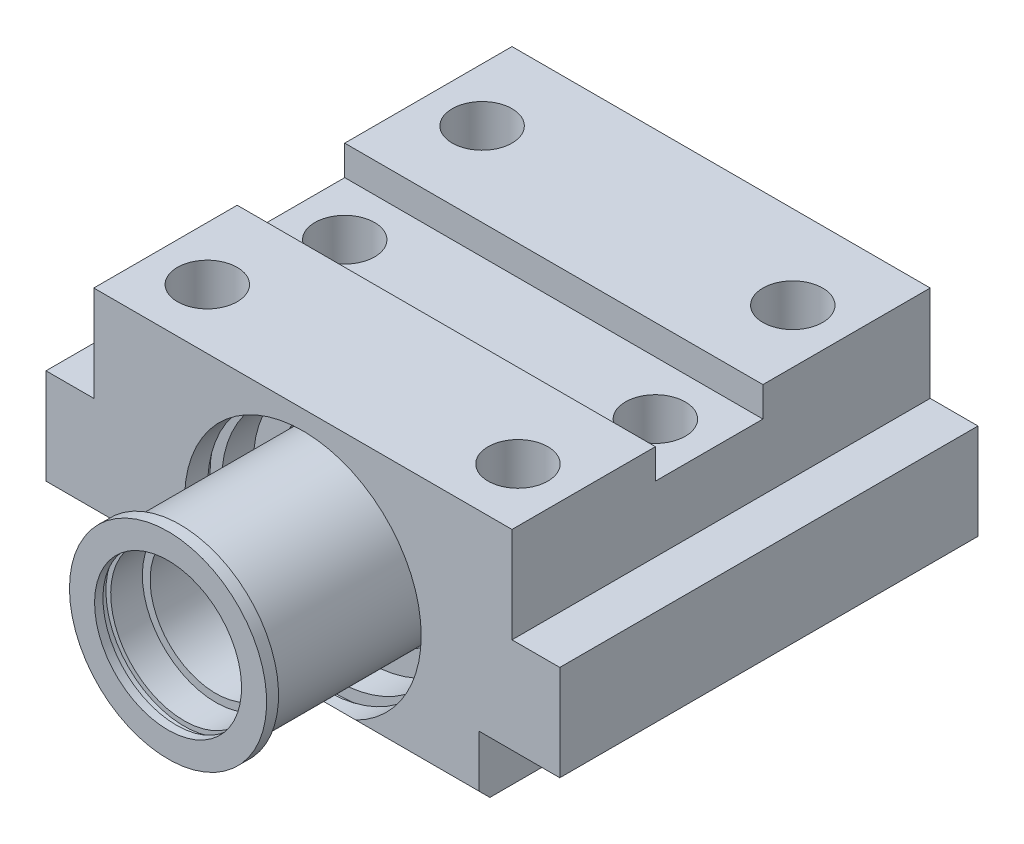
ISO-10303-21;
HEADER;
FILE_DESCRIPTION(('STEP AP214'),'2;1');
FILE_NAME('part.step','',(''),(''),'','','');
FILE_SCHEMA(('AUTOMOTIVE_DESIGN { 1 0 10303 214 1 1 1 1 }'));
ENDSEC;
DATA;
#1=APPLICATION_CONTEXT('core data for automotive mechanical design processes');
#2=APPLICATION_PROTOCOL_DEFINITION('international standard','automotive_design',2000,#1);
#3=PRODUCT_CONTEXT('',#1,'mechanical');
#4=PRODUCT('Part','Part','',(#3));
#5=PRODUCT_RELATED_PRODUCT_CATEGORY('part','',(#4));
#6=PRODUCT_DEFINITION_FORMATION('','',#4);
#7=PRODUCT_DEFINITION_CONTEXT('part definition',#1,'design');
#8=PRODUCT_DEFINITION('design','',#6,#7);
#9=PRODUCT_DEFINITION_SHAPE('','',#8);
#10=(LENGTH_UNIT() NAMED_UNIT(*) SI_UNIT(.MILLI.,.METRE.));
#11=(NAMED_UNIT(*) PLANE_ANGLE_UNIT() SI_UNIT($,.RADIAN.));
#12=(NAMED_UNIT(*) SI_UNIT($,.STERADIAN.) SOLID_ANGLE_UNIT());
#13=UNCERTAINTY_MEASURE_WITH_UNIT(LENGTH_MEASURE(1.E-05),#10,'distance_accuracy_value','');
#14=(GEOMETRIC_REPRESENTATION_CONTEXT(3) GLOBAL_UNCERTAINTY_ASSIGNED_CONTEXT((#13)) GLOBAL_UNIT_ASSIGNED_CONTEXT((#10,
#11,#12)) REPRESENTATION_CONTEXT('',''));
#15=CARTESIAN_POINT('',(0.,0.,0.));
#16=DIRECTION('',(0.,0.,1.));
#17=DIRECTION('',(1.,0.,0.));
#18=AXIS2_PLACEMENT_3D('',#15,#16,#17);
#19=CARTESIAN_POINT('',(0.,-23.,-35.));
#20=DIRECTION('',(0.,0.,1.));
#21=DIRECTION('',(1.,0.,0.));
#22=AXIS2_PLACEMENT_3D('',#19,#20,#21);
#23=CYLINDRICAL_SURFACE('',#22,15.5);
#24=CARTESIAN_POINT('',(-1.49034330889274E-13,-22.9999999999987,-0.929380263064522));
#25=DIRECTION('',(0.,0.,1.));
#26=DIRECTION('',(1.,0.,0.));
#27=AXIS2_PLACEMENT_3D('',#24,#25,#26);
#28=CIRCLE('',#27,15.5);
#29=CARTESIAN_POINT('',(15.4999999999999,-22.9999999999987,-0.929380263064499));
#30=VERTEX_POINT('',#29);
#31=EDGE_CURVE('E21',#30,#30,#28,.T.);
#32=ORIENTED_EDGE('',*,*,#31,.T.);
#33=EDGE_LOOP('',(#32));
#34=FACE_BOUND('',#33,.T.);
#35=CARTESIAN_POINT('',(0.,-23.,-26.));
#36=DIRECTION('',(0.,0.,-1.));
#37=DIRECTION('',(-1.,0.,0.));
#38=AXIS2_PLACEMENT_3D('',#35,#36,#37);
#39=CIRCLE('',#38,15.5);
#40=CARTESIAN_POINT('',(-15.5,-23.,-26.));
#41=VERTEX_POINT('',#40);
#42=EDGE_CURVE('E609',#41,#41,#39,.T.);
#43=ORIENTED_EDGE('',*,*,#42,.T.);
#44=EDGE_LOOP('',(#43));
#45=FACE_BOUND('',#44,.T.);
#46=ADVANCED_FACE('F17',(#34,#45),#23,.F.);
#47=CARTESIAN_POINT('',(-35.,0.,35.));
#48=DIRECTION('',(0.,-1.,0.));
#49=DIRECTION('',(1.,0.,0.));
#50=AXIS2_PLACEMENT_3D('',#47,#48,#49);
#51=PLANE('',#50);
#52=CARTESIAN_POINT('',(-26.,0.,24.9999999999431));
#53=DIRECTION('',(0.,1.,0.));
#54=DIRECTION('',(-1.,0.,0.));
#55=AXIS2_PLACEMENT_3D('',#52,#53,#54);
#56=CIRCLE('',#55,5.);
#57=CARTESIAN_POINT('',(-31.,0.,24.9999999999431));
#58=VERTEX_POINT('',#57);
#59=EDGE_CURVE('E1452',#58,#58,#56,.T.);
#60=ORIENTED_EDGE('',*,*,#59,.F.);
#61=EDGE_LOOP('',(#60));
#62=FACE_BOUND('',#61,.T.);
#63=CARTESIAN_POINT('',(26.,0.,24.9999999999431));
#64=DIRECTION('',(0.,1.,0.));
#65=DIRECTION('',(-1.,0.,0.));
#66=AXIS2_PLACEMENT_3D('',#63,#64,#65);
#67=CIRCLE('',#66,5.);
#68=CARTESIAN_POINT('',(21.,0.,24.9999999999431));
#69=VERTEX_POINT('',#68);
#70=EDGE_CURVE('E1454',#69,#69,#67,.T.);
#71=ORIENTED_EDGE('',*,*,#70,.F.);
#72=EDGE_LOOP('',(#71));
#73=FACE_BOUND('',#72,.T.);
#74=DIRECTION('',(1.,0.,0.));
#75=VECTOR('',#74,1.);
#76=CARTESIAN_POINT('',(-35.,0.,11.));
#77=LINE('',#76,#75);
#78=CARTESIAN_POINT('',(35.,0.,11.));
#79=VERTEX_POINT('',#78);
#80=CARTESIAN_POINT('',(-35.,0.,11.));
#81=VERTEX_POINT('',#80);
#82=EDGE_CURVE('E482',#79,#81,#77,.F.);
#83=ORIENTED_EDGE('',*,*,#82,.T.);
#84=DIRECTION('',(0.,0.,-1.));
#85=VECTOR('',#84,1.);
#86=CARTESIAN_POINT('',(-35.,0.,35.));
#87=LINE('',#86,#85);
#88=CARTESIAN_POINT('',(-35.,0.,35.));
#89=VERTEX_POINT('',#88);
#90=EDGE_CURVE('E553',#81,#89,#87,.F.);
#91=ORIENTED_EDGE('',*,*,#90,.T.);
#92=DIRECTION('',(1.,0.,0.));
#93=VECTOR('',#92,1.);
#94=CARTESIAN_POINT('',(-35.,0.,35.));
#95=LINE('',#94,#93);
#96=CARTESIAN_POINT('',(35.,0.,35.));
#97=VERTEX_POINT('',#96);
#98=EDGE_CURVE('E456',#97,#89,#95,.F.);
#99=ORIENTED_EDGE('',*,*,#98,.F.);
#100=DIRECTION('',(0.,0.,-1.));
#101=VECTOR('',#100,1.);
#102=CARTESIAN_POINT('',(35.,0.,35.));
#103=LINE('',#102,#101);
#104=EDGE_CURVE('E558',#79,#97,#103,.F.);
#105=ORIENTED_EDGE('',*,*,#104,.F.);
#106=EDGE_LOOP('',(#83,#91,#99,#105));
#107=FACE_BOUND('',#106,.T.);
#108=ADVANCED_FACE('F775',(#62,#73,#107),#51,.F.);
#109=CARTESIAN_POINT('',(-35.,0.,35.));
#110=DIRECTION('',(0.,-1.,0.));
#111=DIRECTION('',(1.,0.,0.));
#112=AXIS2_PLACEMENT_3D('',#109,#110,#111);
#113=PLANE('',#112);
#114=CARTESIAN_POINT('',(-26.,0.,-21.0000000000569));
#115=DIRECTION('',(0.,1.,0.));
#116=DIRECTION('',(-1.,0.,0.));
#117=AXIS2_PLACEMENT_3D('',#114,#115,#116);
#118=CIRCLE('',#117,5.);
#119=CARTESIAN_POINT('',(-31.,0.,-21.0000000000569));
#120=VERTEX_POINT('',#119);
#121=EDGE_CURVE('E652',#120,#120,#118,.T.);
#122=ORIENTED_EDGE('',*,*,#121,.F.);
#123=EDGE_LOOP('',(#122));
#124=FACE_BOUND('',#123,.T.);
#125=CARTESIAN_POINT('',(26.,0.,-21.0000000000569));
#126=DIRECTION('',(0.,1.,0.));
#127=DIRECTION('',(-1.,0.,0.));
#128=AXIS2_PLACEMENT_3D('',#125,#126,#127);
#129=CIRCLE('',#128,5.);
#130=CARTESIAN_POINT('',(21.,0.,-21.0000000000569));
#131=VERTEX_POINT('',#130);
#132=EDGE_CURVE('E651',#131,#131,#129,.T.);
#133=ORIENTED_EDGE('',*,*,#132,.F.);
#134=EDGE_LOOP('',(#133));
#135=FACE_BOUND('',#134,.T.);
#136=DIRECTION('',(-1.,0.,0.));
#137=VECTOR('',#136,1.);
#138=CARTESIAN_POINT('',(-35.,0.,-7.));
#139=LINE('',#138,#137);
#140=CARTESIAN_POINT('',(-35.,0.,-7.));
#141=VERTEX_POINT('',#140);
#142=CARTESIAN_POINT('',(35.,0.,-7.));
#143=VERTEX_POINT('',#142);
#144=EDGE_CURVE('E485',#141,#143,#139,.F.);
#145=ORIENTED_EDGE('',*,*,#144,.T.);
#146=DIRECTION('',(0.,0.,1.));
#147=VECTOR('',#146,1.);
#148=CARTESIAN_POINT('',(35.,0.,35.));
#149=LINE('',#148,#147);
#150=CARTESIAN_POINT('',(35.,1.11022302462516E-13,-35.));
#151=VERTEX_POINT('',#150);
#152=EDGE_CURVE('E523',#143,#151,#149,.F.);
#153=ORIENTED_EDGE('',*,*,#152,.T.);
#154=DIRECTION('',(1.,0.,0.));
#155=VECTOR('',#154,1.);
#156=CARTESIAN_POINT('',(-35.,1.11022302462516E-13,-35.));
#157=LINE('',#156,#155);
#158=CARTESIAN_POINT('',(-35.,0.,-35.));
#159=VERTEX_POINT('',#158);
#160=EDGE_CURVE('E479',#159,#151,#157,.T.);
#161=ORIENTED_EDGE('',*,*,#160,.F.);
#162=DIRECTION('',(0.,0.,-1.));
#163=VECTOR('',#162,1.);
#164=CARTESIAN_POINT('',(-35.,0.,35.));
#165=LINE('',#164,#163);
#166=EDGE_CURVE('E548',#159,#141,#165,.F.);
#167=ORIENTED_EDGE('',*,*,#166,.T.);
#168=EDGE_LOOP('',(#145,#153,#161,#167));
#169=FACE_BOUND('',#168,.T.);
#170=ADVANCED_FACE('F730',(#124,#135,#169),#113,.F.);
#171=CARTESIAN_POINT('',(0.,-23.,24.));
#172=DIRECTION('',(0.,0.,1.));
#173=DIRECTION('',(1.,0.,0.));
#174=AXIS2_PLACEMENT_3D('',#171,#172,#173);
#175=PLANE('',#174);
#176=CARTESIAN_POINT('',(0.,-23.,24.));
#177=DIRECTION('',(0.,0.,1.));
#178=DIRECTION('',(1.,0.,0.));
#179=AXIS2_PLACEMENT_3D('',#176,#177,#178);
#180=CIRCLE('',#179,15.5);
#181=CARTESIAN_POINT('',(15.5,-23.,24.));
#182=VERTEX_POINT('',#181);
#183=EDGE_CURVE('E11',#182,#182,#180,.T.);
#184=ORIENTED_EDGE('',*,*,#183,.F.);
#185=EDGE_LOOP('',(#184));
#186=FACE_BOUND('',#185,.T.);
#187=CARTESIAN_POINT('',(0.,-23.,24.));
#188=DIRECTION('',(0.,0.,1.));
#189=DIRECTION('',(1.,0.,0.));
#190=AXIS2_PLACEMENT_3D('',#187,#188,#189);
#191=CIRCLE('',#190,19.3);
#192=CARTESIAN_POINT('',(19.3,-23.,24.));
#193=VERTEX_POINT('',#192);
#194=EDGE_CURVE('E329',#193,#193,#191,.T.);
#195=ORIENTED_EDGE('',*,*,#194,.T.);
#196=EDGE_LOOP('',(#195));
#197=FACE_BOUND('',#196,.T.);
#198=ADVANCED_FACE('F800',(#186,#197),#175,.T.);
#199=CARTESIAN_POINT('',(-35.,-5.,11.));
#200=DIRECTION('',(0.,0.,1.));
#201=DIRECTION('',(1.,0.,0.));
#202=AXIS2_PLACEMENT_3D('',#199,#200,#201);
#203=PLANE('',#202);
#204=DIRECTION('',(0.,-1.,0.));
#205=VECTOR('',#204,1.);
#206=CARTESIAN_POINT('',(-35.,-16.,11.));
#207=LINE('',#206,#205);
#208=CARTESIAN_POINT('',(-35.,-5.,11.));
#209=VERTEX_POINT('',#208);
#210=EDGE_CURVE('E433',#209,#81,#207,.F.);
#211=ORIENTED_EDGE('',*,*,#210,.T.);
#212=ORIENTED_EDGE('',*,*,#82,.F.);
#213=DIRECTION('',(0.,-1.,0.));
#214=VECTOR('',#213,1.);
#215=CARTESIAN_POINT('',(35.,-5.,11.));
#216=LINE('',#215,#214);
#217=CARTESIAN_POINT('',(35.,-5.,11.));
#218=VERTEX_POINT('',#217);
#219=EDGE_CURVE('E380',#218,#79,#216,.F.);
#220=ORIENTED_EDGE('',*,*,#219,.F.);
#221=DIRECTION('',(1.,0.,0.));
#222=VECTOR('',#221,1.);
#223=CARTESIAN_POINT('',(0.,-5.,11.));
#224=LINE('',#223,#222);
#225=EDGE_CURVE('E302',#209,#218,#224,.T.);
#226=ORIENTED_EDGE('',*,*,#225,.F.);
#227=EDGE_LOOP('',(#211,#212,#220,#226));
#228=FACE_BOUND('',#227,.T.);
#229=ADVANCED_FACE('F803',(#228),#203,.F.);
#230=CARTESIAN_POINT('',(-35.,-5.,-7.));
#231=DIRECTION('',(0.,0.,-1.));
#232=DIRECTION('',(-1.,0.,0.));
#233=AXIS2_PLACEMENT_3D('',#230,#231,#232);
#234=PLANE('',#233);
#235=DIRECTION('',(0.,-1.,0.));
#236=VECTOR('',#235,1.);
#237=CARTESIAN_POINT('',(35.,0.,-7.));
#238=LINE('',#237,#236);
#239=CARTESIAN_POINT('',(35.,-5.,-6.9999999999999));
#240=VERTEX_POINT('',#239);
#241=EDGE_CURVE('E384',#240,#143,#238,.F.);
#242=ORIENTED_EDGE('',*,*,#241,.T.);
#243=ORIENTED_EDGE('',*,*,#144,.F.);
#244=DIRECTION('',(0.,-1.,0.));
#245=VECTOR('',#244,1.);
#246=CARTESIAN_POINT('',(-35.,-5.,-7.));
#247=LINE('',#246,#245);
#248=CARTESIAN_POINT('',(-35.,-5.,-7.));
#249=VERTEX_POINT('',#248);
#250=EDGE_CURVE('E431',#249,#141,#247,.F.);
#251=ORIENTED_EDGE('',*,*,#250,.F.);
#252=DIRECTION('',(1.,0.,0.));
#253=VECTOR('',#252,1.);
#254=CARTESIAN_POINT('',(0.,-5.,-7.));
#255=LINE('',#254,#253);
#256=EDGE_CURVE('E305',#240,#249,#255,.F.);
#257=ORIENTED_EDGE('',*,*,#256,.F.);
#258=EDGE_LOOP('',(#242,#243,#251,#257));
#259=FACE_BOUND('',#258,.T.);
#260=ADVANCED_FACE('F812',(#259),#234,.F.);
#261=CARTESIAN_POINT('',(0.,-23.,24.));
#262=DIRECTION('',(0.,0.,1.));
#263=DIRECTION('',(1.,0.,0.));
#264=AXIS2_PLACEMENT_3D('',#261,#262,#263);
#265=CYLINDRICAL_SURFACE('',#264,19.3);
#266=ORIENTED_EDGE('',*,*,#194,.F.);
#267=EDGE_LOOP('',(#266));
#268=FACE_BOUND('',#267,.T.);
#269=CARTESIAN_POINT('',(0.,-23.,29.3));
#270=DIRECTION('',(0.,0.,1.));
#271=DIRECTION('',(1.,0.,0.));
#272=AXIS2_PLACEMENT_3D('',#269,#270,#271);
#273=CIRCLE('',#272,19.3);
#274=CARTESIAN_POINT('',(19.3,-23.,29.3));
#275=VERTEX_POINT('',#274);
#276=EDGE_CURVE('E304',#275,#275,#273,.F.);
#277=ORIENTED_EDGE('',*,*,#276,.F.);
#278=EDGE_LOOP('',(#277));
#279=FACE_BOUND('',#278,.T.);
#280=ADVANCED_FACE('F808',(#268,#279),#265,.F.);
#281=CARTESIAN_POINT('',(0.,-4.99999999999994,0.));
#282=DIRECTION('',(0.,1.,0.));
#283=DIRECTION('',(0.,0.,1.));
#284=AXIS2_PLACEMENT_3D('',#281,#282,#283);
#285=PLANE('',#284);
#286=CARTESIAN_POINT('',(-26.,-4.99999999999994,1.99999999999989));
#287=DIRECTION('',(0.,1.,0.));
#288=DIRECTION('',(-1.,0.,0.));
#289=AXIS2_PLACEMENT_3D('',#286,#287,#288);
#290=CIRCLE('',#289,5.);
#291=CARTESIAN_POINT('',(-31.,-4.99999999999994,1.99999999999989));
#292=VERTEX_POINT('',#291);
#293=EDGE_CURVE('E1457',#292,#292,#290,.T.);
#294=ORIENTED_EDGE('',*,*,#293,.F.);
#295=EDGE_LOOP('',(#294));
#296=FACE_BOUND('',#295,.T.);
#297=CARTESIAN_POINT('',(26.,-4.99999999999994,2.));
#298=DIRECTION('',(0.,1.,0.));
#299=DIRECTION('',(-1.,0.,0.));
#300=AXIS2_PLACEMENT_3D('',#297,#298,#299);
#301=CIRCLE('',#300,5.);
#302=CARTESIAN_POINT('',(21.,-4.99999999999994,2.));
#303=VERTEX_POINT('',#302);
#304=EDGE_CURVE('E1453',#303,#303,#301,.T.);
#305=ORIENTED_EDGE('',*,*,#304,.F.);
#306=EDGE_LOOP('',(#305));
#307=FACE_BOUND('',#306,.T.);
#308=ORIENTED_EDGE('',*,*,#225,.T.);
#309=DIRECTION('',(0.,0.,1.));
#310=VECTOR('',#309,1.);
#311=CARTESIAN_POINT('',(35.,-5.,35.));
#312=LINE('',#311,#310);
#313=EDGE_CURVE('E285',#218,#240,#312,.F.);
#314=ORIENTED_EDGE('',*,*,#313,.T.);
#315=ORIENTED_EDGE('',*,*,#256,.T.);
#316=DIRECTION('',(0.,0.,-1.));
#317=VECTOR('',#316,1.);
#318=CARTESIAN_POINT('',(-35.,-5.,35.));
#319=LINE('',#318,#317);
#320=EDGE_CURVE('E294',#249,#209,#319,.F.);
#321=ORIENTED_EDGE('',*,*,#320,.T.);
#322=EDGE_LOOP('',(#308,#314,#315,#321));
#323=FACE_BOUND('',#322,.T.);
#324=ADVANCED_FACE('F811',(#296,#307,#323),#285,.T.);
#325=CARTESIAN_POINT('',(0.,-23.,29.3));
#326=DIRECTION('',(0.,0.,1.));
#327=DIRECTION('',(1.,0.,0.));
#328=AXIS2_PLACEMENT_3D('',#325,#326,#327);
#329=PLANE('',#328);
#330=ORIENTED_EDGE('',*,*,#276,.T.);
#331=EDGE_LOOP('',(#330));
#332=FACE_BOUND('',#331,.T.);
#333=CARTESIAN_POINT('',(0.,-23.,29.3));
#334=DIRECTION('',(0.,0.,-1.));
#335=DIRECTION('',(-1.,0.,0.));
#336=AXIS2_PLACEMENT_3D('',#333,#334,#335);
#337=CIRCLE('',#336,21.25);
#338=CARTESIAN_POINT('',(-21.25,-23.,29.3));
#339=VERTEX_POINT('',#338);
#340=EDGE_CURVE('E275',#339,#339,#337,.F.);
#341=ORIENTED_EDGE('',*,*,#340,.T.);
#342=EDGE_LOOP('',(#341));
#343=FACE_BOUND('',#342,.T.);
#344=ADVANCED_FACE('F816',(#332,#343),#329,.T.);
#345=CARTESIAN_POINT('',(-43.,-32.,35.));
#346=DIRECTION('',(1.,0.,0.));
#347=DIRECTION('',(0.,0.,-1.));
#348=AXIS2_PLACEMENT_3D('',#345,#346,#347);
#349=PLANE('',#348);
#350=DIRECTION('',(0.,-1.,0.));
#351=VECTOR('',#350,1.);
#352=CARTESIAN_POINT('',(-43.,1.11022302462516E-13,-35.));
#353=LINE('',#352,#351);
#354=CARTESIAN_POINT('',(-43.,-16.,-35.));
#355=VERTEX_POINT('',#354);
#356=CARTESIAN_POINT('',(-43.,-32.,-35.));
#357=VERTEX_POINT('',#356);
#358=EDGE_CURVE('E422',#355,#357,#353,.T.);
#359=ORIENTED_EDGE('',*,*,#358,.T.);
#360=DIRECTION('',(0.,0.,-1.));
#361=VECTOR('',#360,1.);
#362=CARTESIAN_POINT('',(-43.,-32.,35.));
#363=LINE('',#362,#361);
#364=CARTESIAN_POINT('',(-43.,-32.,35.));
#365=VERTEX_POINT('',#364);
#366=EDGE_CURVE('E538',#357,#365,#363,.F.);
#367=ORIENTED_EDGE('',*,*,#366,.T.);
#368=DIRECTION('',(0.,1.,0.));
#369=VECTOR('',#368,1.);
#370=CARTESIAN_POINT('',(-43.,-32.,35.));
#371=LINE('',#370,#369);
#372=CARTESIAN_POINT('',(-43.,-16.,35.));
#373=VERTEX_POINT('',#372);
#374=EDGE_CURVE('E441',#373,#365,#371,.F.);
#375=ORIENTED_EDGE('',*,*,#374,.F.);
#376=DIRECTION('',(0.,0.,-1.));
#377=VECTOR('',#376,1.);
#378=CARTESIAN_POINT('',(-43.,-16.,35.));
#379=LINE('',#378,#377);
#380=EDGE_CURVE('E543',#355,#373,#379,.F.);
#381=ORIENTED_EDGE('',*,*,#380,.F.);
#382=EDGE_LOOP('',(#359,#367,#375,#381));
#383=FACE_BOUND('',#382,.T.);
#384=ADVANCED_FACE('F716',(#383),#349,.F.);
#385=CARTESIAN_POINT('',(-43.,-16.,35.));
#386=DIRECTION('',(0.,-1.,0.));
#387=DIRECTION('',(0.,0.,-1.));
#388=AXIS2_PLACEMENT_3D('',#385,#386,#387);
#389=PLANE('',#388);
#390=DIRECTION('',(-1.,0.,0.));
#391=VECTOR('',#390,1.);
#392=CARTESIAN_POINT('',(0.,-16.,-35.));
#393=LINE('',#392,#391);
#394=CARTESIAN_POINT('',(-35.,-16.,-35.));
#395=VERTEX_POINT('',#394);
#396=EDGE_CURVE('E474',#395,#355,#393,.T.);
#397=ORIENTED_EDGE('',*,*,#396,.T.);
#398=ORIENTED_EDGE('',*,*,#380,.T.);
#399=DIRECTION('',(1.,0.,0.));
#400=VECTOR('',#399,1.);
#401=CARTESIAN_POINT('',(-43.,-16.,35.));
#402=LINE('',#401,#400);
#403=CARTESIAN_POINT('',(-35.,-16.,35.));
#404=VERTEX_POINT('',#403);
#405=EDGE_CURVE('E461',#404,#373,#402,.F.);
#406=ORIENTED_EDGE('',*,*,#405,.F.);
#407=DIRECTION('',(0.,0.,-1.));
#408=VECTOR('',#407,1.);
#409=CARTESIAN_POINT('',(-35.,-16.,35.));
#410=LINE('',#409,#408);
#411=EDGE_CURVE('E289',#404,#395,#410,.T.);
#412=ORIENTED_EDGE('',*,*,#411,.T.);
#413=EDGE_LOOP('',(#397,#398,#406,#412));
#414=FACE_BOUND('',#413,.T.);
#415=ADVANCED_FACE('F719',(#414),#389,.F.);
#416=CARTESIAN_POINT('',(-35.,-16.,35.));
#417=DIRECTION('',(1.,0.,0.));
#418=DIRECTION('',(0.,0.,-1.));
#419=AXIS2_PLACEMENT_3D('',#416,#417,#418);
#420=PLANE('',#419);
#421=ORIENTED_EDGE('',*,*,#320,.F.);
#422=ORIENTED_EDGE('',*,*,#250,.T.);
#423=ORIENTED_EDGE('',*,*,#166,.F.);
#424=DIRECTION('',(0.,1.,0.));
#425=VECTOR('',#424,1.);
#426=CARTESIAN_POINT('',(-35.,-16.,-35.));
#427=LINE('',#426,#425);
#428=EDGE_CURVE('E427',#395,#159,#427,.T.);
#429=ORIENTED_EDGE('',*,*,#428,.F.);
#430=ORIENTED_EDGE('',*,*,#411,.F.);
#431=DIRECTION('',(0.,-1.,0.));
#432=VECTOR('',#431,1.);
#433=CARTESIAN_POINT('',(-35.,0.,35.));
#434=LINE('',#433,#432);
#435=EDGE_CURVE('E437',#404,#89,#434,.F.);
#436=ORIENTED_EDGE('',*,*,#435,.T.);
#437=ORIENTED_EDGE('',*,*,#90,.F.);
#438=ORIENTED_EDGE('',*,*,#210,.F.);
#439=EDGE_LOOP('',(#421,#422,#423,#429,#430,#436,#437,#438));
#440=FACE_BOUND('',#439,.T.);
#441=ADVANCED_FACE('F726',(#440),#420,.F.);
#442=CARTESIAN_POINT('',(35.,0.,35.));
#443=DIRECTION('',(-1.,0.,0.));
#444=DIRECTION('',(0.,0.,1.));
#445=AXIS2_PLACEMENT_3D('',#442,#443,#444);
#446=PLANE('',#445);
#447=ORIENTED_EDGE('',*,*,#241,.F.);
#448=ORIENTED_EDGE('',*,*,#313,.F.);
#449=ORIENTED_EDGE('',*,*,#219,.T.);
#450=ORIENTED_EDGE('',*,*,#104,.T.);
#451=DIRECTION('',(0.,-1.,0.));
#452=VECTOR('',#451,1.);
#453=CARTESIAN_POINT('',(35.,0.,35.));
#454=LINE('',#453,#452);
#455=CARTESIAN_POINT('',(35.,-16.,35.));
#456=VERTEX_POINT('',#455);
#457=EDGE_CURVE('E446',#456,#97,#454,.F.);
#458=ORIENTED_EDGE('',*,*,#457,.F.);
#459=DIRECTION('',(0.,0.,1.));
#460=VECTOR('',#459,1.);
#461=CARTESIAN_POINT('',(35.,-16.,35.));
#462=LINE('',#461,#460);
#463=CARTESIAN_POINT('',(35.,-16.,-35.));
#464=VERTEX_POINT('',#463);
#465=EDGE_CURVE('E288',#456,#464,#462,.F.);
#466=ORIENTED_EDGE('',*,*,#465,.T.);
#467=DIRECTION('',(0.,1.,0.));
#468=VECTOR('',#467,1.);
#469=CARTESIAN_POINT('',(35.,1.11022302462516E-13,-35.));
#470=LINE('',#469,#468);
#471=EDGE_CURVE('E377',#464,#151,#470,.T.);
#472=ORIENTED_EDGE('',*,*,#471,.T.);
#473=ORIENTED_EDGE('',*,*,#152,.F.);
#474=EDGE_LOOP('',(#447,#448,#449,#450,#458,#466,#472,#473));
#475=FACE_BOUND('',#474,.T.);
#476=ADVANCED_FACE('F736',(#475),#446,.F.);
#477=CARTESIAN_POINT('',(35.,-16.,35.));
#478=DIRECTION('',(0.,-1.,0.));
#479=DIRECTION('',(1.,0.,0.));
#480=AXIS2_PLACEMENT_3D('',#477,#478,#479);
#481=PLANE('',#480);
#482=DIRECTION('',(-1.,0.,0.));
#483=VECTOR('',#482,1.);
#484=CARTESIAN_POINT('',(0.,-16.,35.));
#485=LINE('',#484,#483);
#486=CARTESIAN_POINT('',(43.,-16.,35.));
#487=VERTEX_POINT('',#486);
#488=EDGE_CURVE('E451',#456,#487,#485,.F.);
#489=ORIENTED_EDGE('',*,*,#488,.T.);
#490=DIRECTION('',(0.,0.,1.));
#491=VECTOR('',#490,1.);
#492=CARTESIAN_POINT('',(43.,-16.,35.));
#493=LINE('',#492,#491);
#494=CARTESIAN_POINT('',(43.,-16.,-35.));
#495=VERTEX_POINT('',#494);
#496=EDGE_CURVE('E528',#487,#495,#493,.F.);
#497=ORIENTED_EDGE('',*,*,#496,.T.);
#498=DIRECTION('',(1.,0.,0.));
#499=VECTOR('',#498,1.);
#500=CARTESIAN_POINT('',(35.,-16.,-35.));
#501=LINE('',#500,#499);
#502=EDGE_CURVE('E490',#464,#495,#501,.T.);
#503=ORIENTED_EDGE('',*,*,#502,.F.);
#504=ORIENTED_EDGE('',*,*,#465,.F.);
#505=EDGE_LOOP('',(#489,#497,#503,#504));
#506=FACE_BOUND('',#505,.T.);
#507=ADVANCED_FACE('F740',(#506),#481,.F.);
#508=CARTESIAN_POINT('',(43.,-16.,35.));
#509=DIRECTION('',(-1.,0.,0.));
#510=DIRECTION('',(0.,0.,1.));
#511=AXIS2_PLACEMENT_3D('',#508,#509,#510);
#512=PLANE('',#511);
#513=DIRECTION('',(0.,-1.,0.));
#514=VECTOR('',#513,1.);
#515=CARTESIAN_POINT('',(43.,-16.,-35.));
#516=LINE('',#515,#514);
#517=CARTESIAN_POINT('',(43.,-32.,-35.));
#518=VERTEX_POINT('',#517);
#519=EDGE_CURVE('E373',#495,#518,#516,.T.);
#520=ORIENTED_EDGE('',*,*,#519,.F.);
#521=ORIENTED_EDGE('',*,*,#496,.F.);
#522=DIRECTION('',(0.,-1.,0.));
#523=VECTOR('',#522,1.);
#524=CARTESIAN_POINT('',(43.,-16.,35.));
#525=LINE('',#524,#523);
#526=CARTESIAN_POINT('',(43.,-32.,35.));
#527=VERTEX_POINT('',#526);
#528=EDGE_CURVE('E342',#527,#487,#525,.F.);
#529=ORIENTED_EDGE('',*,*,#528,.F.);
#530=DIRECTION('',(0.,0.,-1.));
#531=VECTOR('',#530,1.);
#532=CARTESIAN_POINT('',(43.,-32.,35.));
#533=LINE('',#532,#531);
#534=EDGE_CURVE('E533',#518,#527,#533,.F.);
#535=ORIENTED_EDGE('',*,*,#534,.F.);
#536=EDGE_LOOP('',(#520,#521,#529,#535));
#537=FACE_BOUND('',#536,.T.);
#538=ADVANCED_FACE('F743',(#537),#512,.F.);
#539=CARTESIAN_POINT('',(0.,-23.,31.15));
#540=DIRECTION('',(0.,0.,-1.));
#541=DIRECTION('',(-1.,0.,0.));
#542=AXIS2_PLACEMENT_3D('',#539,#540,#541);
#543=CYLINDRICAL_SURFACE('',#542,21.25);
#544=ORIENTED_EDGE('',*,*,#340,.F.);
#545=EDGE_LOOP('',(#544));
#546=FACE_BOUND('',#545,.T.);
#547=CARTESIAN_POINT('',(0.,-23.,31.15));
#548=DIRECTION('',(0.,0.,-1.));
#549=DIRECTION('',(-1.,0.,0.));
#550=AXIS2_PLACEMENT_3D('',#547,#548,#549);
#551=CIRCLE('',#550,21.25);
#552=CARTESIAN_POINT('',(-21.25,-23.,31.15));
#553=VERTEX_POINT('',#552);
#554=EDGE_CURVE('E258',#553,#553,#551,.F.);
#555=ORIENTED_EDGE('',*,*,#554,.T.);
#556=EDGE_LOOP('',(#555));
#557=FACE_BOUND('',#556,.T.);
#558=ADVANCED_FACE('F822',(#546,#557),#543,.F.);
#559=CARTESIAN_POINT('',(43.,-32.,35.));
#560=DIRECTION('',(0.,1.,0.));
#561=DIRECTION('',(-1.,0.,0.));
#562=AXIS2_PLACEMENT_3D('',#559,#560,#561);
#563=PLANE('',#562);
#564=DIRECTION('',(1.,0.,0.));
#565=VECTOR('',#564,1.);
#566=CARTESIAN_POINT('',(0.,-32.,-35.));
#567=LINE('',#566,#565);
#568=CARTESIAN_POINT('',(29.5,-32.,-35.));
#569=VERTEX_POINT('',#568);
#570=EDGE_CURVE('E495',#569,#518,#567,.T.);
#571=ORIENTED_EDGE('',*,*,#570,.T.);
#572=ORIENTED_EDGE('',*,*,#534,.T.);
#573=DIRECTION('',(-1.,0.,0.));
#574=VECTOR('',#573,1.);
#575=CARTESIAN_POINT('',(43.,-32.,35.));
#576=LINE('',#575,#574);
#577=CARTESIAN_POINT('',(29.5,-32.,35.));
#578=VERTEX_POINT('',#577);
#579=EDGE_CURVE('E515',#578,#527,#576,.F.);
#580=ORIENTED_EDGE('',*,*,#579,.F.);
#581=DIRECTION('',(0.,0.,1.));
#582=VECTOR('',#581,1.);
#583=CARTESIAN_POINT('',(29.5,-32.,35.));
#584=LINE('',#583,#582);
#585=EDGE_CURVE('E279',#578,#569,#584,.F.);
#586=ORIENTED_EDGE('',*,*,#585,.T.);
#587=EDGE_LOOP('',(#571,#572,#580,#586));
#588=FACE_BOUND('',#587,.T.);
#589=ADVANCED_FACE('F747',(#588),#563,.F.);
#590=CARTESIAN_POINT('',(29.5,-42.5,35.));
#591=DIRECTION('',(0.707106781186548,-0.707106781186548,0.));
#592=DIRECTION('',(0.707106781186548,0.707106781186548,0.));
#593=AXIS2_PLACEMENT_3D('',#590,#591,#592);
#594=PLANE('',#593);
#595=DIRECTION('',(0.707106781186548,0.707106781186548,0.));
#596=VECTOR('',#595,1.);
#597=CARTESIAN_POINT('',(29.5,-42.5,-21.));
#598=LINE('',#597,#596);
#599=CARTESIAN_POINT('',(29.,-43.,-21.));
#600=VERTEX_POINT('',#599);
#601=CARTESIAN_POINT('',(27.3,-44.7,-21.));
#602=VERTEX_POINT('',#601);
#603=EDGE_CURVE('E354',#600,#602,#598,.F.);
#604=ORIENTED_EDGE('',*,*,#603,.F.);
#605=DIRECTION('',(0.,0.,1.));
#606=VECTOR('',#605,1.);
#607=CARTESIAN_POINT('',(29.,-43.,-28.));
#608=LINE('',#607,#606);
#609=CARTESIAN_POINT('',(29.,-43.,-35.));
#610=VERTEX_POINT('',#609);
#611=EDGE_CURVE('E259',#610,#600,#608,.T.);
#612=ORIENTED_EDGE('',*,*,#611,.F.);
#613=DIRECTION('',(0.707106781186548,0.707106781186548,0.));
#614=VECTOR('',#613,1.);
#615=CARTESIAN_POINT('',(29.5,-42.5,-35.));
#616=LINE('',#615,#614);
#617=CARTESIAN_POINT('',(29.5,-42.5,-35.));
#618=VERTEX_POINT('',#617);
#619=EDGE_CURVE('E505',#618,#610,#616,.F.);
#620=ORIENTED_EDGE('',*,*,#619,.F.);
#621=DIRECTION('',(0.,0.,1.));
#622=VECTOR('',#621,1.);
#623=CARTESIAN_POINT('',(29.5,-42.5,35.));
#624=LINE('',#623,#622);
#625=CARTESIAN_POINT('',(29.5,-42.5,33.2));
#626=VERTEX_POINT('',#625);
#627=EDGE_CURVE('E270',#618,#626,#624,.T.);
#628=ORIENTED_EDGE('',*,*,#627,.T.);
#629=DIRECTION('',(-0.577350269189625,-0.577350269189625,-0.577350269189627));
#630=VECTOR('',#629,1.);
#631=CARTESIAN_POINT('',(20.8666666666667,-51.1333333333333,24.5666666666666));
#632=LINE('',#631,#630);
#633=CARTESIAN_POINT('',(27.3,-44.7,31.));
#634=VERTEX_POINT('',#633);
#635=EDGE_CURVE('E363',#626,#634,#632,.T.);
#636=ORIENTED_EDGE('',*,*,#635,.T.);
#637=DIRECTION('',(0.,0.,1.));
#638=VECTOR('',#637,1.);
#639=CARTESIAN_POINT('',(27.3,-44.7,35.));
#640=LINE('',#639,#638);
#641=EDGE_CURVE('E358',#602,#634,#640,.T.);
#642=ORIENTED_EDGE('',*,*,#641,.F.);
#643=EDGE_LOOP('',(#604,#612,#620,#628,#636,#642));
#644=FACE_BOUND('',#643,.T.);
#645=ADVANCED_FACE('F680',(#644),#594,.T.);
#646=CARTESIAN_POINT('',(19.,-43.,-28.));
#647=DIRECTION('',(0.,-1.,0.));
#648=DIRECTION('',(1.,0.,0.));
#649=AXIS2_PLACEMENT_3D('',#646,#647,#648);
#650=PLANE('',#649);
#651=DIRECTION('',(0.,0.,1.));
#652=VECTOR('',#651,1.);
#653=CARTESIAN_POINT('',(12.,-43.,-28.));
#654=LINE('',#653,#652);
#655=CARTESIAN_POINT('',(12.,-43.,-35.));
#656=VERTEX_POINT('',#655);
#657=CARTESIAN_POINT('',(12.,-43.,-28.));
#658=VERTEX_POINT('',#657);
#659=EDGE_CURVE('E219',#656,#658,#654,.T.);
#660=ORIENTED_EDGE('',*,*,#659,.F.);
#661=DIRECTION('',(-1.,0.,0.));
#662=VECTOR('',#661,1.);
#663=CARTESIAN_POINT('',(0.,-43.,-35.));
#664=LINE('',#663,#662);
#665=EDGE_CURVE('E500',#656,#610,#664,.F.);
#666=ORIENTED_EDGE('',*,*,#665,.T.);
#667=ORIENTED_EDGE('',*,*,#611,.T.);
#668=DIRECTION('',(-1.,0.,0.));
#669=VECTOR('',#668,1.);
#670=CARTESIAN_POINT('',(29.5,-43.,-21.));
#671=LINE('',#670,#669);
#672=CARTESIAN_POINT('',(19.,-43.,-21.));
#673=VERTEX_POINT('',#672);
#674=EDGE_CURVE('E268',#673,#600,#671,.F.);
#675=ORIENTED_EDGE('',*,*,#674,.F.);
#676=CARTESIAN_POINT('',(19.,-43.,-28.));
#677=DIRECTION('',(0.,-1.,0.));
#678=DIRECTION('',(1.,0.,0.));
#679=AXIS2_PLACEMENT_3D('',#676,#677,#678);
#680=CIRCLE('',#679,7.);
#681=EDGE_CURVE('E240',#673,#658,#680,.T.);
#682=ORIENTED_EDGE('',*,*,#681,.T.);
#683=EDGE_LOOP('',(#660,#666,#667,#675,#682));
#684=FACE_BOUND('',#683,.T.);
#685=ADVANCED_FACE('F689',(#684),#650,.T.);
#686=CARTESIAN_POINT('',(-19.,-43.,-28.));
#687=DIRECTION('',(0.,1.,0.));
#688=DIRECTION('',(-1.,0.,0.));
#689=AXIS2_PLACEMENT_3D('',#686,#687,#688);
#690=PLANE('',#689);
#691=DIRECTION('',(0.,0.,1.));
#692=VECTOR('',#691,1.);
#693=CARTESIAN_POINT('',(-29.,-43.,35.));
#694=LINE('',#693,#692);
#695=CARTESIAN_POINT('',(-29.,-43.,-21.));
#696=VERTEX_POINT('',#695);
#697=CARTESIAN_POINT('',(-29.,-43.,-35.));
#698=VERTEX_POINT('',#697);
#699=EDGE_CURVE('E256',#696,#698,#694,.F.);
#700=ORIENTED_EDGE('',*,*,#699,.T.);
#701=DIRECTION('',(-1.,0.,0.));
#702=VECTOR('',#701,1.);
#703=CARTESIAN_POINT('',(-19.,-43.,-35.));
#704=LINE('',#703,#702);
#705=CARTESIAN_POINT('',(-12.,-43.,-35.));
#706=VERTEX_POINT('',#705);
#707=EDGE_CURVE('E216',#706,#698,#704,.T.);
#708=ORIENTED_EDGE('',*,*,#707,.F.);
#709=DIRECTION('',(0.,0.,1.));
#710=VECTOR('',#709,1.);
#711=CARTESIAN_POINT('',(-12.,-43.,-28.));
#712=LINE('',#711,#710);
#713=CARTESIAN_POINT('',(-12.,-43.,-28.));
#714=VERTEX_POINT('',#713);
#715=EDGE_CURVE('E211',#714,#706,#712,.F.);
#716=ORIENTED_EDGE('',*,*,#715,.F.);
#717=CARTESIAN_POINT('',(-19.,-43.,-28.));
#718=DIRECTION('',(0.,-1.,0.));
#719=DIRECTION('',(1.,0.,0.));
#720=AXIS2_PLACEMENT_3D('',#717,#718,#719);
#721=CIRCLE('',#720,7.);
#722=CARTESIAN_POINT('',(-19.,-43.,-21.));
#723=VERTEX_POINT('',#722);
#724=EDGE_CURVE('E201',#714,#723,#721,.T.);
#725=ORIENTED_EDGE('',*,*,#724,.T.);
#726=DIRECTION('',(-1.,0.,0.));
#727=VECTOR('',#726,1.);
#728=CARTESIAN_POINT('',(-29.5,-43.,-21.));
#729=LINE('',#728,#727);
#730=EDGE_CURVE('E226',#696,#723,#729,.F.);
#731=ORIENTED_EDGE('',*,*,#730,.F.);
#732=EDGE_LOOP('',(#700,#708,#716,#725,#731));
#733=FACE_BOUND('',#732,.T.);
#734=ADVANCED_FACE('F214',(#733),#690,.F.);
#735=CARTESIAN_POINT('',(-29.5,-42.5,35.));
#736=DIRECTION('',(0.707106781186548,0.707106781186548,0.));
#737=DIRECTION('',(-0.707106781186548,0.707106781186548,0.));
#738=AXIS2_PLACEMENT_3D('',#735,#736,#737);
#739=PLANE('',#738);
#740=ORIENTED_EDGE('',*,*,#699,.F.);
#741=DIRECTION('',(0.707106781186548,-0.707106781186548,0.));
#742=VECTOR('',#741,1.);
#743=CARTESIAN_POINT('',(-29.25,-42.75,-21.));
#744=LINE('',#743,#742);
#745=CARTESIAN_POINT('',(-27.3,-44.7,-21.));
#746=VERTEX_POINT('',#745);
#747=EDGE_CURVE('E402',#696,#746,#744,.T.);
#748=ORIENTED_EDGE('',*,*,#747,.T.);
#749=DIRECTION('',(0.,0.,-1.));
#750=VECTOR('',#749,1.);
#751=CARTESIAN_POINT('',(-27.3,-44.7,35.));
#752=LINE('',#751,#750);
#753=CARTESIAN_POINT('',(-27.3,-44.7,31.));
#754=VERTEX_POINT('',#753);
#755=EDGE_CURVE('E407',#746,#754,#752,.F.);
#756=ORIENTED_EDGE('',*,*,#755,.T.);
#757=DIRECTION('',(-0.577350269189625,0.577350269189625,0.577350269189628));
#758=VECTOR('',#757,1.);
#759=CARTESIAN_POINT('',(-30.1,-41.9,33.8));
#760=LINE('',#759,#758);
#761=CARTESIAN_POINT('',(-29.5,-42.5,33.2));
#762=VERTEX_POINT('',#761);
#763=EDGE_CURVE('E412',#762,#754,#760,.F.);
#764=ORIENTED_EDGE('',*,*,#763,.F.);
#765=DIRECTION('',(0.,0.,1.));
#766=VECTOR('',#765,1.);
#767=CARTESIAN_POINT('',(-29.5,-42.5,35.));
#768=LINE('',#767,#766);
#769=CARTESIAN_POINT('',(-29.5,-42.5,-35.));
#770=VERTEX_POINT('',#769);
#771=EDGE_CURVE('E243',#762,#770,#768,.F.);
#772=ORIENTED_EDGE('',*,*,#771,.T.);
#773=DIRECTION('',(0.707106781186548,-0.707106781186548,0.));
#774=VECTOR('',#773,1.);
#775=CARTESIAN_POINT('',(-36.,-36.,-35.));
#776=LINE('',#775,#774);
#777=EDGE_CURVE('E512',#770,#698,#776,.T.);
#778=ORIENTED_EDGE('',*,*,#777,.T.);
#779=EDGE_LOOP('',(#740,#748,#756,#764,#772,#778));
#780=FACE_BOUND('',#779,.T.);
#781=ADVANCED_FACE('F703',(#780),#739,.F.);
#782=CARTESIAN_POINT('',(-29.5,-32.,35.));
#783=DIRECTION('',(0.,1.,0.));
#784=DIRECTION('',(-1.,0.,0.));
#785=AXIS2_PLACEMENT_3D('',#782,#783,#784);
#786=PLANE('',#785);
#787=DIRECTION('',(0.,0.,1.));
#788=VECTOR('',#787,1.);
#789=CARTESIAN_POINT('',(-29.5,-32.,35.));
#790=LINE('',#789,#788);
#791=CARTESIAN_POINT('',(-29.5,-32.,-35.));
#792=VERTEX_POINT('',#791);
#793=CARTESIAN_POINT('',(-29.5,-32.,35.));
#794=VERTEX_POINT('',#793);
#795=EDGE_CURVE('E246',#792,#794,#790,.T.);
#796=ORIENTED_EDGE('',*,*,#795,.T.);
#797=DIRECTION('',(1.,0.,0.));
#798=VECTOR('',#797,1.);
#799=CARTESIAN_POINT('',(0.,-32.,35.));
#800=LINE('',#799,#798);
#801=EDGE_CURVE('E466',#794,#365,#800,.F.);
#802=ORIENTED_EDGE('',*,*,#801,.T.);
#803=ORIENTED_EDGE('',*,*,#366,.F.);
#804=DIRECTION('',(-1.,0.,0.));
#805=VECTOR('',#804,1.);
#806=CARTESIAN_POINT('',(-29.5,-32.,-35.));
#807=LINE('',#806,#805);
#808=EDGE_CURVE('E470',#792,#357,#807,.T.);
#809=ORIENTED_EDGE('',*,*,#808,.F.);
#810=EDGE_LOOP('',(#796,#802,#803,#809));
#811=FACE_BOUND('',#810,.T.);
#812=ADVANCED_FACE('F712',(#811),#786,.F.);
#813=CARTESIAN_POINT('',(0.,-23.,31.15));
#814=DIRECTION('',(0.,0.,1.));
#815=DIRECTION('',(1.,0.,0.));
#816=AXIS2_PLACEMENT_3D('',#813,#814,#815);
#817=PLANE('',#816);
#818=ORIENTED_EDGE('',*,*,#554,.F.);
#819=EDGE_LOOP('',(#818));
#820=FACE_BOUND('',#819,.T.);
#821=CARTESIAN_POINT('',(0.,-23.,31.15));
#822=DIRECTION('',(0.,0.,1.));
#823=DIRECTION('',(1.,0.,0.));
#824=AXIS2_PLACEMENT_3D('',#821,#822,#823);
#825=CIRCLE('',#824,19.8);
#826=CARTESIAN_POINT('',(19.8,-23.,31.15));
#827=VERTEX_POINT('',#826);
#828=EDGE_CURVE('E250',#827,#827,#825,.T.);
#829=ORIENTED_EDGE('',*,*,#828,.T.);
#830=EDGE_LOOP('',(#829));
#831=FACE_BOUND('',#830,.T.);
#832=ADVANCED_FACE('F761',(#820,#831),#817,.F.);
#833=CARTESIAN_POINT('',(29.5,-32.,35.));
#834=DIRECTION('',(-1.,0.,0.));
#835=DIRECTION('',(0.,-1.,0.));
#836=AXIS2_PLACEMENT_3D('',#833,#834,#835);
#837=PLANE('',#836);
#838=DIRECTION('',(0.,0.707106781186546,0.707106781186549));
#839=VECTOR('',#838,1.);
#840=CARTESIAN_POINT('',(29.5,-40.7,35.));
#841=LINE('',#840,#839);
#842=CARTESIAN_POINT('',(29.5,-40.7,35.));
#843=VERTEX_POINT('',#842);
#844=EDGE_CURVE('E349',#843,#626,#841,.F.);
#845=ORIENTED_EDGE('',*,*,#844,.T.);
#846=ORIENTED_EDGE('',*,*,#627,.F.);
#847=DIRECTION('',(0.,-1.,0.));
#848=VECTOR('',#847,1.);
#849=CARTESIAN_POINT('',(29.5,-32.,-35.));
#850=LINE('',#849,#848);
#851=EDGE_CURVE('E368',#569,#618,#850,.T.);
#852=ORIENTED_EDGE('',*,*,#851,.F.);
#853=ORIENTED_EDGE('',*,*,#585,.F.);
#854=DIRECTION('',(0.,1.,0.));
#855=VECTOR('',#854,1.);
#856=CARTESIAN_POINT('',(29.5,0.,35.));
#857=LINE('',#856,#855);
#858=EDGE_CURVE('E344',#578,#843,#857,.F.);
#859=ORIENTED_EDGE('',*,*,#858,.T.);
#860=EDGE_LOOP('',(#845,#846,#852,#853,#859));
#861=FACE_BOUND('',#860,.T.);
#862=ADVANCED_FACE('F751',(#861),#837,.F.);
#863=CARTESIAN_POINT('',(29.5,-43.,-21.));
#864=DIRECTION('',(0.,0.,-1.));
#865=DIRECTION('',(-1.,0.,0.));
#866=AXIS2_PLACEMENT_3D('',#863,#864,#865);
#867=PLANE('',#866);
#868=DIRECTION('',(0.,-1.,0.));
#869=VECTOR('',#868,1.);
#870=CARTESIAN_POINT('',(19.,-43.,-21.));
#871=LINE('',#870,#869);
#872=CARTESIAN_POINT('',(19.,-44.7,-21.));
#873=VERTEX_POINT('',#872);
#874=EDGE_CURVE('E235',#873,#673,#871,.F.);
#875=ORIENTED_EDGE('',*,*,#874,.T.);
#876=ORIENTED_EDGE('',*,*,#674,.T.);
#877=ORIENTED_EDGE('',*,*,#603,.T.);
#878=DIRECTION('',(-1.,0.,0.));
#879=VECTOR('',#878,1.);
#880=CARTESIAN_POINT('',(29.5,-44.7,-21.));
#881=LINE('',#880,#879);
#882=EDGE_CURVE('E563',#602,#873,#881,.T.);
#883=ORIENTED_EDGE('',*,*,#882,.T.);
#884=EDGE_LOOP('',(#875,#876,#877,#883));
#885=FACE_BOUND('',#884,.T.);
#886=ADVANCED_FACE('F686',(#885),#867,.T.);
#887=CARTESIAN_POINT('',(19.,-43.,-28.));
#888=DIRECTION('',(0.,-1.,0.));
#889=DIRECTION('',(1.,0.,0.));
#890=AXIS2_PLACEMENT_3D('',#887,#888,#889);
#891=CYLINDRICAL_SURFACE('',#890,7.);
#892=ORIENTED_EDGE('',*,*,#874,.F.);
#893=CARTESIAN_POINT('',(19.,-44.7,-28.));
#894=DIRECTION('',(0.,1.,0.));
#895=DIRECTION('',(-1.,0.,0.));
#896=AXIS2_PLACEMENT_3D('',#893,#894,#895);
#897=CIRCLE('',#896,7.);
#898=CARTESIAN_POINT('',(12.,-44.7,-28.));
#899=VERTEX_POINT('',#898);
#900=EDGE_CURVE('E600',#899,#873,#897,.T.);
#901=ORIENTED_EDGE('',*,*,#900,.F.);
#902=DIRECTION('',(0.,1.,0.));
#903=VECTOR('',#902,1.);
#904=CARTESIAN_POINT('',(12.,-43.,-28.));
#905=LINE('',#904,#903);
#906=EDGE_CURVE('E233',#658,#899,#905,.F.);
#907=ORIENTED_EDGE('',*,*,#906,.F.);
#908=ORIENTED_EDGE('',*,*,#681,.F.);
#909=EDGE_LOOP('',(#892,#901,#907,#908));
#910=FACE_BOUND('',#909,.T.);
#911=ADVANCED_FACE('F900',(#910),#891,.F.);
#912=CARTESIAN_POINT('',(12.,-43.,-28.));
#913=DIRECTION('',(1.,0.,0.));
#914=DIRECTION('',(0.,1.,0.));
#915=AXIS2_PLACEMENT_3D('',#912,#913,#914);
#916=PLANE('',#915);
#917=ORIENTED_EDGE('',*,*,#906,.T.);
#918=DIRECTION('',(0.,0.,1.));
#919=VECTOR('',#918,1.);
#920=CARTESIAN_POINT('',(12.,-44.7,-28.));
#921=LINE('',#920,#919);
#922=CARTESIAN_POINT('',(12.,-44.7,-35.));
#923=VERTEX_POINT('',#922);
#924=EDGE_CURVE('E595',#923,#899,#921,.T.);
#925=ORIENTED_EDGE('',*,*,#924,.F.);
#926=DIRECTION('',(0.,1.,0.));
#927=VECTOR('',#926,1.);
#928=CARTESIAN_POINT('',(12.,-43.,-35.));
#929=LINE('',#928,#927);
#930=EDGE_CURVE('E383',#656,#923,#929,.F.);
#931=ORIENTED_EDGE('',*,*,#930,.F.);
#932=ORIENTED_EDGE('',*,*,#659,.T.);
#933=EDGE_LOOP('',(#917,#925,#931,#932));
#934=FACE_BOUND('',#933,.T.);
#935=ADVANCED_FACE('F698',(#934),#916,.T.);
#936=CARTESIAN_POINT('',(0.,1.11022302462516E-13,-35.));
#937=DIRECTION('',(0.,0.,-1.));
#938=DIRECTION('',(-1.,0.,0.));
#939=AXIS2_PLACEMENT_3D('',#936,#937,#938);
#940=PLANE('',#939);
#941=CARTESIAN_POINT('',(-35.0000000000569,-24.,-35.));
#942=DIRECTION('',(0.,0.,-1.));
#943=DIRECTION('',(-1.,0.,0.));
#944=AXIS2_PLACEMENT_3D('',#941,#942,#943);
#945=CIRCLE('',#944,5.);
#946=CARTESIAN_POINT('',(-40.0000000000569,-24.,-35.));
#947=VERTEX_POINT('',#946);
#948=EDGE_CURVE('E634',#947,#947,#945,.T.);
#949=ORIENTED_EDGE('',*,*,#948,.F.);
#950=EDGE_LOOP('',(#949));
#951=FACE_BOUND('',#950,.T.);
#952=CARTESIAN_POINT('',(34.9999999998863,-24.,-35.));
#953=DIRECTION('',(0.,0.,-1.));
#954=DIRECTION('',(-1.,0.,0.));
#955=AXIS2_PLACEMENT_3D('',#952,#953,#954);
#956=CIRCLE('',#955,5.);
#957=CARTESIAN_POINT('',(29.9999999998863,-24.,-35.));
#958=VERTEX_POINT('',#957);
#959=EDGE_CURVE('E619',#958,#958,#956,.T.);
#960=ORIENTED_EDGE('',*,*,#959,.F.);
#961=EDGE_LOOP('',(#960));
#962=FACE_BOUND('',#961,.T.);
#963=CARTESIAN_POINT('',(0.,-23.,-35.));
#964=DIRECTION('',(0.,0.,-1.));
#965=DIRECTION('',(-1.,0.,0.));
#966=AXIS2_PLACEMENT_3D('',#963,#964,#965);
#967=CIRCLE('',#966,19.8);
#968=CARTESIAN_POINT('',(-19.8,-23.,-35.));
#969=VERTEX_POINT('',#968);
#970=EDGE_CURVE('E26',#969,#969,#967,.T.);
#971=ORIENTED_EDGE('',*,*,#970,.F.);
#972=EDGE_LOOP('',(#971));
#973=FACE_BOUND('',#972,.T.);
#974=ORIENTED_EDGE('',*,*,#570,.F.);
#975=ORIENTED_EDGE('',*,*,#851,.T.);
#976=ORIENTED_EDGE('',*,*,#619,.T.);
#977=ORIENTED_EDGE('',*,*,#665,.F.);
#978=ORIENTED_EDGE('',*,*,#930,.T.);
#979=DIRECTION('',(1.,0.,0.));
#980=VECTOR('',#979,1.);
#981=CARTESIAN_POINT('',(0.,-44.7,-35.));
#982=LINE('',#981,#980);
#983=CARTESIAN_POINT('',(-12.,-44.7,-35.));
#984=VERTEX_POINT('',#983);
#985=EDGE_CURVE('E590',#984,#923,#982,.T.);
#986=ORIENTED_EDGE('',*,*,#985,.F.);
#987=DIRECTION('',(0.,1.,0.));
#988=VECTOR('',#987,1.);
#989=CARTESIAN_POINT('',(-12.,1.11022302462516E-13,-35.));
#990=LINE('',#989,#988);
#991=EDGE_CURVE('E388',#706,#984,#990,.F.);
#992=ORIENTED_EDGE('',*,*,#991,.F.);
#993=ORIENTED_EDGE('',*,*,#707,.T.);
#994=ORIENTED_EDGE('',*,*,#777,.F.);
#995=DIRECTION('',(0.,-1.,0.));
#996=VECTOR('',#995,1.);
#997=CARTESIAN_POINT('',(-29.5,0.,-35.));
#998=LINE('',#997,#996);
#999=EDGE_CURVE('E417',#792,#770,#998,.T.);
#1000=ORIENTED_EDGE('',*,*,#999,.F.);
#1001=ORIENTED_EDGE('',*,*,#808,.T.);
#1002=ORIENTED_EDGE('',*,*,#358,.F.);
#1003=ORIENTED_EDGE('',*,*,#396,.F.);
#1004=ORIENTED_EDGE('',*,*,#428,.T.);
#1005=ORIENTED_EDGE('',*,*,#160,.T.);
#1006=ORIENTED_EDGE('',*,*,#471,.F.);
#1007=ORIENTED_EDGE('',*,*,#502,.T.);
#1008=ORIENTED_EDGE('',*,*,#519,.T.);
#1009=EDGE_LOOP('',(#974,#975,#976,#977,#978,#986,#992,#993,#994,#1000,#1001,#1002,#1003,#1004,
#1005,#1006,#1007,#1008));
#1010=FACE_BOUND('',#1009,.T.);
#1011=ADVANCED_FACE('F694',(#951,#962,#973,#1010),#940,.T.);
#1012=CARTESIAN_POINT('',(-12.,-43.,-28.));
#1013=DIRECTION('',(-1.,0.,0.));
#1014=DIRECTION('',(0.,-1.,0.));
#1015=AXIS2_PLACEMENT_3D('',#1012,#1013,#1014);
#1016=PLANE('',#1015);
#1017=DIRECTION('',(0.,-1.,0.));
#1018=VECTOR('',#1017,1.);
#1019=CARTESIAN_POINT('',(-12.,-43.,-28.));
#1020=LINE('',#1019,#1018);
#1021=CARTESIAN_POINT('',(-12.,-44.7,-28.));
#1022=VERTEX_POINT('',#1021);
#1023=EDGE_CURVE('E206',#1022,#714,#1020,.F.);
#1024=ORIENTED_EDGE('',*,*,#1023,.T.);
#1025=ORIENTED_EDGE('',*,*,#715,.T.);
#1026=ORIENTED_EDGE('',*,*,#991,.T.);
#1027=DIRECTION('',(0.,0.,-1.));
#1028=VECTOR('',#1027,1.);
#1029=CARTESIAN_POINT('',(-12.,-44.7,-28.));
#1030=LINE('',#1029,#1028);
#1031=EDGE_CURVE('E223',#1022,#984,#1030,.T.);
#1032=ORIENTED_EDGE('',*,*,#1031,.F.);
#1033=EDGE_LOOP('',(#1024,#1025,#1026,#1032));
#1034=FACE_BOUND('',#1033,.T.);
#1035=ADVANCED_FACE('F221',(#1034),#1016,.T.);
#1036=CARTESIAN_POINT('',(-19.,-43.,-28.));
#1037=DIRECTION('',(0.,-1.,0.));
#1038=DIRECTION('',(1.,0.,0.));
#1039=AXIS2_PLACEMENT_3D('',#1036,#1037,#1038);
#1040=CYLINDRICAL_SURFACE('',#1039,7.);
#1041=ORIENTED_EDGE('',*,*,#1023,.F.);
#1042=CARTESIAN_POINT('',(-19.,-44.7,-28.));
#1043=DIRECTION('',(0.,1.,0.));
#1044=DIRECTION('',(-1.,0.,0.));
#1045=AXIS2_PLACEMENT_3D('',#1042,#1043,#1044);
#1046=CIRCLE('',#1045,7.);
#1047=CARTESIAN_POINT('',(-19.,-44.7,-21.));
#1048=VERTEX_POINT('',#1047);
#1049=EDGE_CURVE('E583',#1048,#1022,#1046,.T.);
#1050=ORIENTED_EDGE('',*,*,#1049,.F.);
#1051=DIRECTION('',(0.,1.,0.));
#1052=VECTOR('',#1051,1.);
#1053=CARTESIAN_POINT('',(-19.,-43.,-21.));
#1054=LINE('',#1053,#1052);
#1055=EDGE_CURVE('E208',#723,#1048,#1054,.F.);
#1056=ORIENTED_EDGE('',*,*,#1055,.F.);
#1057=ORIENTED_EDGE('',*,*,#724,.F.);
#1058=EDGE_LOOP('',(#1041,#1050,#1056,#1057));
#1059=FACE_BOUND('',#1058,.T.);
#1060=ADVANCED_FACE('F203',(#1059),#1040,.F.);
#1061=CARTESIAN_POINT('',(-29.5,-43.,-21.));
#1062=DIRECTION('',(0.,0.,-1.));
#1063=DIRECTION('',(-1.,0.,0.));
#1064=AXIS2_PLACEMENT_3D('',#1061,#1062,#1063);
#1065=PLANE('',#1064);
#1066=ORIENTED_EDGE('',*,*,#1055,.T.);
#1067=DIRECTION('',(1.,0.,0.));
#1068=VECTOR('',#1067,1.);
#1069=CARTESIAN_POINT('',(29.5,-44.7,-21.));
#1070=LINE('',#1069,#1068);
#1071=EDGE_CURVE('E578',#746,#1048,#1070,.T.);
#1072=ORIENTED_EDGE('',*,*,#1071,.F.);
#1073=ORIENTED_EDGE('',*,*,#747,.F.);
#1074=ORIENTED_EDGE('',*,*,#730,.T.);
#1075=EDGE_LOOP('',(#1066,#1072,#1073,#1074));
#1076=FACE_BOUND('',#1075,.T.);
#1077=ADVANCED_FACE('F949',(#1076),#1065,.T.);
#1078=CARTESIAN_POINT('',(-29.5,-44.7,35.));
#1079=DIRECTION('',(1.,0.,0.));
#1080=DIRECTION('',(0.,1.,0.));
#1081=AXIS2_PLACEMENT_3D('',#1078,#1079,#1080);
#1082=PLANE('',#1081);
#1083=DIRECTION('',(0.,1.,0.));
#1084=VECTOR('',#1083,1.);
#1085=CARTESIAN_POINT('',(-29.5,-44.7,35.));
#1086=LINE('',#1085,#1084);
#1087=CARTESIAN_POINT('',(-29.5,-40.7,35.));
#1088=VERTEX_POINT('',#1087);
#1089=EDGE_CURVE('E392',#794,#1088,#1086,.F.);
#1090=ORIENTED_EDGE('',*,*,#1089,.F.);
#1091=ORIENTED_EDGE('',*,*,#795,.F.);
#1092=ORIENTED_EDGE('',*,*,#999,.T.);
#1093=ORIENTED_EDGE('',*,*,#771,.F.);
#1094=DIRECTION('',(0.,0.707106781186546,0.707106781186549));
#1095=VECTOR('',#1094,1.);
#1096=CARTESIAN_POINT('',(-29.5,-42.7,33.));
#1097=LINE('',#1096,#1095);
#1098=EDGE_CURVE('E397',#1088,#762,#1097,.F.);
#1099=ORIENTED_EDGE('',*,*,#1098,.F.);
#1100=EDGE_LOOP('',(#1090,#1091,#1092,#1093,#1099));
#1101=FACE_BOUND('',#1100,.T.);
#1102=ADVANCED_FACE('F707',(#1101),#1082,.F.);
#1103=CARTESIAN_POINT('',(0.,0.,35.));
#1104=DIRECTION('',(0.,0.,-1.));
#1105=DIRECTION('',(-1.,0.,0.));
#1106=AXIS2_PLACEMENT_3D('',#1103,#1104,#1105);
#1107=PLANE('',#1106);
#1108=ORIENTED_EDGE('',*,*,#858,.F.);
#1109=ORIENTED_EDGE('',*,*,#579,.T.);
#1110=ORIENTED_EDGE('',*,*,#528,.T.);
#1111=ORIENTED_EDGE('',*,*,#488,.F.);
#1112=ORIENTED_EDGE('',*,*,#457,.T.);
#1113=ORIENTED_EDGE('',*,*,#98,.T.);
#1114=ORIENTED_EDGE('',*,*,#435,.F.);
#1115=ORIENTED_EDGE('',*,*,#405,.T.);
#1116=ORIENTED_EDGE('',*,*,#374,.T.);
#1117=ORIENTED_EDGE('',*,*,#801,.F.);
#1118=ORIENTED_EDGE('',*,*,#1089,.T.);
#1119=DIRECTION('',(1.,0.,0.));
#1120=VECTOR('',#1119,1.);
#1121=CARTESIAN_POINT('',(0.,-40.7,35.));
#1122=LINE('',#1121,#1120);
#1123=CARTESIAN_POINT('',(-8.87411967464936,-40.7,35.));
#1124=VERTEX_POINT('',#1123);
#1125=EDGE_CURVE('E314',#1088,#1124,#1122,.T.);
#1126=ORIENTED_EDGE('',*,*,#1125,.T.);
#1127=CARTESIAN_POINT('',(0.,-23.,35.));
#1128=DIRECTION('',(0.,0.,-1.));
#1129=DIRECTION('',(-1.,0.,0.));
#1130=AXIS2_PLACEMENT_3D('',#1127,#1128,#1129);
#1131=CIRCLE('',#1130,19.8);
#1132=CARTESIAN_POINT('',(8.87411967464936,-40.7,35.));
#1133=VERTEX_POINT('',#1132);
#1134=EDGE_CURVE('E605',#1133,#1124,#1131,.F.);
#1135=ORIENTED_EDGE('',*,*,#1134,.F.);
#1136=DIRECTION('',(1.,0.,0.));
#1137=VECTOR('',#1136,1.);
#1138=CARTESIAN_POINT('',(0.,-40.7,35.));
#1139=LINE('',#1138,#1137);
#1140=EDGE_CURVE('E316',#1133,#843,#1139,.T.);
#1141=ORIENTED_EDGE('',*,*,#1140,.T.);
#1142=EDGE_LOOP('',(#1108,#1109,#1110,#1111,#1112,#1113,#1114,#1115,#1116,#1117,#1118,#1126,
#1135,#1141));
#1143=FACE_BOUND('',#1142,.T.);
#1144=ADVANCED_FACE('F754',(#1143),#1107,.F.);
#1145=CARTESIAN_POINT('',(0.,-23.,30.));
#1146=DIRECTION('',(0.,0.,1.));
#1147=DIRECTION('',(1.,0.,0.));
#1148=AXIS2_PLACEMENT_3D('',#1145,#1146,#1147);
#1149=CYLINDRICAL_SURFACE('',#1148,19.8);
#1150=CARTESIAN_POINT('',(0.,-23.,52.7));
#1151=DIRECTION('',(0.,0.707106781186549,-0.707106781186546));
#1152=DIRECTION('',(0.,0.707106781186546,0.707106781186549));
#1153=AXIS2_PLACEMENT_3D('',#1150,#1151,#1152);
#1154=ELLIPSE('',#1153,28.0014285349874,19.8);
#1155=EDGE_CURVE('E34',#1124,#1133,#1154,.F.);
#1156=ORIENTED_EDGE('',*,*,#1155,.T.);
#1157=ORIENTED_EDGE('',*,*,#1134,.T.);
#1158=EDGE_LOOP('',(#1156,#1157));
#1159=FACE_BOUND('',#1158,.T.);
#1160=ORIENTED_EDGE('',*,*,#828,.F.);
#1161=EDGE_LOOP('',(#1160));
#1162=FACE_BOUND('',#1161,.T.);
#1163=ADVANCED_FACE('F755',(#1159,#1162),#1149,.F.);
#1164=CARTESIAN_POINT('',(0.,-40.7,35.));
#1165=DIRECTION('',(0.,0.707106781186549,-0.707106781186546));
#1166=DIRECTION('',(0.,0.707106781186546,0.707106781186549));
#1167=AXIS2_PLACEMENT_3D('',#1164,#1165,#1166);
#1168=PLANE('',#1167);
#1169=ORIENTED_EDGE('',*,*,#1155,.F.);
#1170=ORIENTED_EDGE('',*,*,#1125,.F.);
#1171=ORIENTED_EDGE('',*,*,#1098,.T.);
#1172=ORIENTED_EDGE('',*,*,#763,.T.);
#1173=DIRECTION('',(-1.,0.,0.));
#1174=VECTOR('',#1173,1.);
#1175=CARTESIAN_POINT('',(29.5,-44.7,31.));
#1176=LINE('',#1175,#1174);
#1177=EDGE_CURVE('E313',#754,#634,#1176,.F.);
#1178=ORIENTED_EDGE('',*,*,#1177,.T.);
#1179=ORIENTED_EDGE('',*,*,#635,.F.);
#1180=ORIENTED_EDGE('',*,*,#844,.F.);
#1181=ORIENTED_EDGE('',*,*,#1140,.F.);
#1182=EDGE_LOOP('',(#1169,#1170,#1171,#1172,#1178,#1179,#1180,#1181));
#1183=FACE_BOUND('',#1182,.T.);
#1184=ADVANCED_FACE('F673',(#1183),#1168,.F.);
#1185=CARTESIAN_POINT('',(29.5,-44.7,35.));
#1186=DIRECTION('',(0.,1.,0.));
#1187=DIRECTION('',(-1.,0.,0.));
#1188=AXIS2_PLACEMENT_3D('',#1185,#1186,#1187);
#1189=PLANE('',#1188);
#1190=ORIENTED_EDGE('',*,*,#882,.F.);
#1191=ORIENTED_EDGE('',*,*,#641,.T.);
#1192=ORIENTED_EDGE('',*,*,#1177,.F.);
#1193=ORIENTED_EDGE('',*,*,#755,.F.);
#1194=ORIENTED_EDGE('',*,*,#1071,.T.);
#1195=ORIENTED_EDGE('',*,*,#1049,.T.);
#1196=ORIENTED_EDGE('',*,*,#1031,.T.);
#1197=ORIENTED_EDGE('',*,*,#985,.T.);
#1198=ORIENTED_EDGE('',*,*,#924,.T.);
#1199=ORIENTED_EDGE('',*,*,#900,.T.);
#1200=EDGE_LOOP('',(#1190,#1191,#1192,#1193,#1194,#1195,#1196,#1197,#1198,#1199));
#1201=FACE_BOUND('',#1200,.T.);
#1202=ADVANCED_FACE('F683',(#1201),#1189,.F.);
#1203=CARTESIAN_POINT('',(0.,-23.,-31.3));
#1204=DIRECTION('',(0.,0.,-1.));
#1205=DIRECTION('',(-1.,0.,0.));
#1206=AXIS2_PLACEMENT_3D('',#1203,#1204,#1205);
#1207=PLANE('',#1206);
#1208=CARTESIAN_POINT('',(0.,-23.,-31.3));
#1209=DIRECTION('',(0.,0.,-1.));
#1210=DIRECTION('',(-1.,0.,0.));
#1211=AXIS2_PLACEMENT_3D('',#1208,#1209,#1210);
#1212=CIRCLE('',#1211,19.3);
#1213=CARTESIAN_POINT('',(-19.3,-23.,-31.3));
#1214=VERTEX_POINT('',#1213);
#1215=EDGE_CURVE('E335',#1214,#1214,#1212,.F.);
#1216=ORIENTED_EDGE('',*,*,#1215,.T.);
#1217=EDGE_LOOP('',(#1216));
#1218=FACE_BOUND('',#1217,.T.);
#1219=CARTESIAN_POINT('',(0.,-23.,-31.3));
#1220=DIRECTION('',(0.,0.,1.));
#1221=DIRECTION('',(1.,0.,0.));
#1222=AXIS2_PLACEMENT_3D('',#1219,#1220,#1221);
#1223=CIRCLE('',#1222,21.25);
#1224=CARTESIAN_POINT('',(21.25,-23.,-31.3));
#1225=VERTEX_POINT('',#1224);
#1226=EDGE_CURVE('E332',#1225,#1225,#1223,.F.);
#1227=ORIENTED_EDGE('',*,*,#1226,.T.);
#1228=EDGE_LOOP('',(#1227));
#1229=FACE_BOUND('',#1228,.T.);
#1230=ADVANCED_FACE('F805',(#1218,#1229),#1207,.T.);
#1231=CARTESIAN_POINT('',(0.,-23.,-26.));
#1232=DIRECTION('',(0.,0.,-1.));
#1233=DIRECTION('',(-1.,0.,0.));
#1234=AXIS2_PLACEMENT_3D('',#1231,#1232,#1233);
#1235=CYLINDRICAL_SURFACE('',#1234,19.3);
#1236=CARTESIAN_POINT('',(0.,-23.,-26.));
#1237=DIRECTION('',(0.,0.,-1.));
#1238=DIRECTION('',(-1.,0.,0.));
#1239=AXIS2_PLACEMENT_3D('',#1236,#1237,#1238);
#1240=CIRCLE('',#1239,19.3);
#1241=CARTESIAN_POINT('',(-19.3,-23.,-26.));
#1242=VERTEX_POINT('',#1241);
#1243=EDGE_CURVE('E338',#1242,#1242,#1240,.T.);
#1244=ORIENTED_EDGE('',*,*,#1243,.F.);
#1245=EDGE_LOOP('',(#1244));
#1246=FACE_BOUND('',#1245,.T.);
#1247=ORIENTED_EDGE('',*,*,#1215,.F.);
#1248=EDGE_LOOP('',(#1247));
#1249=FACE_BOUND('',#1248,.T.);
#1250=ADVANCED_FACE('F867',(#1246,#1249),#1235,.F.);
#1251=CARTESIAN_POINT('',(0.,-23.,-26.));
#1252=DIRECTION('',(0.,0.,-1.));
#1253=DIRECTION('',(-1.,0.,0.));
#1254=AXIS2_PLACEMENT_3D('',#1251,#1252,#1253);
#1255=PLANE('',#1254);
#1256=ORIENTED_EDGE('',*,*,#42,.F.);
#1257=EDGE_LOOP('',(#1256));
#1258=FACE_BOUND('',#1257,.T.);
#1259=ORIENTED_EDGE('',*,*,#1243,.T.);
#1260=EDGE_LOOP('',(#1259));
#1261=FACE_BOUND('',#1260,.T.);
#1262=ADVANCED_FACE('F862',(#1258,#1261),#1255,.T.);
#1263=CARTESIAN_POINT('',(0.,-23.,-33.15));
#1264=DIRECTION('',(0.,0.,1.));
#1265=DIRECTION('',(1.,0.,0.));
#1266=AXIS2_PLACEMENT_3D('',#1263,#1264,#1265);
#1267=CYLINDRICAL_SURFACE('',#1266,21.25);
#1268=ORIENTED_EDGE('',*,*,#1226,.F.);
#1269=EDGE_LOOP('',(#1268));
#1270=FACE_BOUND('',#1269,.T.);
#1271=CARTESIAN_POINT('',(0.,-23.,-33.15));
#1272=DIRECTION('',(0.,0.,1.));
#1273=DIRECTION('',(1.,0.,0.));
#1274=AXIS2_PLACEMENT_3D('',#1271,#1272,#1273);
#1275=CIRCLE('',#1274,21.25);
#1276=CARTESIAN_POINT('',(21.25,-23.,-33.15));
#1277=VERTEX_POINT('',#1276);
#1278=EDGE_CURVE('E309',#1277,#1277,#1275,.F.);
#1279=ORIENTED_EDGE('',*,*,#1278,.T.);
#1280=EDGE_LOOP('',(#1279));
#1281=FACE_BOUND('',#1280,.T.);
#1282=ADVANCED_FACE('F852',(#1270,#1281),#1267,.F.);
#1283=CARTESIAN_POINT('',(0.,-23.,-33.15));
#1284=DIRECTION('',(0.,0.,-1.));
#1285=DIRECTION('',(-1.,0.,0.));
#1286=AXIS2_PLACEMENT_3D('',#1283,#1284,#1285);
#1287=PLANE('',#1286);
#1288=ORIENTED_EDGE('',*,*,#1278,.F.);
#1289=EDGE_LOOP('',(#1288));
#1290=FACE_BOUND('',#1289,.T.);
#1291=CARTESIAN_POINT('',(0.,-23.,-33.15));
#1292=DIRECTION('',(0.,0.,-1.));
#1293=DIRECTION('',(-1.,0.,0.));
#1294=AXIS2_PLACEMENT_3D('',#1291,#1292,#1293);
#1295=CIRCLE('',#1294,19.8);
#1296=CARTESIAN_POINT('',(-19.8,-23.,-33.15));
#1297=VERTEX_POINT('',#1296);
#1298=EDGE_CURVE('E299',#1297,#1297,#1295,.T.);
#1299=ORIENTED_EDGE('',*,*,#1298,.T.);
#1300=EDGE_LOOP('',(#1299));
#1301=FACE_BOUND('',#1300,.T.);
#1302=ADVANCED_FACE('F795',(#1290,#1301),#1287,.F.);
#1303=CARTESIAN_POINT('',(0.,-23.,24.7028570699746));
#1304=DIRECTION('',(0.,0.,-1.));
#1305=DIRECTION('',(-1.,0.,0.));
#1306=AXIS2_PLACEMENT_3D('',#1303,#1304,#1305);
#1307=CYLINDRICAL_SURFACE('',#1306,19.8);
#1308=ORIENTED_EDGE('',*,*,#1298,.F.);
#1309=EDGE_LOOP('',(#1308));
#1310=FACE_BOUND('',#1309,.T.);
#1311=ORIENTED_EDGE('',*,*,#970,.T.);
#1312=EDGE_LOOP('',(#1311));
#1313=FACE_BOUND('',#1312,.T.);
#1314=ADVANCED_FACE('F786',(#1310,#1313),#1307,.F.);
#1315=CARTESIAN_POINT('',(-1.77883810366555E-13,-22.9999999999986,23.0706197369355));
#1316=DIRECTION('',(0.,0.,-1.));
#1317=DIRECTION('',(-1.,0.,0.));
#1318=AXIS2_PLACEMENT_3D('',#1315,#1316,#1317);
#1319=CIRCLE('',#1318,15.5);
#1320=CARTESIAN_POINT('',(-15.5000000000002,-22.9999999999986,23.0706197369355));
#1321=VERTEX_POINT('',#1320);
#1322=EDGE_CURVE('E613',#1321,#1321,#1319,.T.);
#1323=ORIENTED_EDGE('',*,*,#1322,.T.);
#1324=EDGE_LOOP('',(#1323));
#1325=FACE_BOUND('',#1324,.T.);
#1326=ORIENTED_EDGE('',*,*,#183,.T.);
#1327=EDGE_LOOP('',(#1326));
#1328=FACE_BOUND('',#1327,.T.);
#1329=ADVANCED_FACE('F19',(#1325,#1328),#23,.F.);
#1330=CARTESIAN_POINT('',(-26.,-20.,-21.0000000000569));
#1331=DIRECTION('',(0.,1.,0.));
#1332=DIRECTION('',(-1.,0.,0.));
#1333=AXIS2_PLACEMENT_3D('',#1330,#1331,#1332);
#1334=PLANE('',#1333);
#1335=CARTESIAN_POINT('',(-26.,-20.,-21.0000000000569));
#1336=DIRECTION('',(0.,1.,0.));
#1337=DIRECTION('',(-1.,0.,0.));
#1338=AXIS2_PLACEMENT_3D('',#1335,#1336,#1337);
#1339=CIRCLE('',#1338,5.);
#1340=CARTESIAN_POINT('',(-31.,-20.,-21.0000000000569));
#1341=VERTEX_POINT('',#1340);
#1342=EDGE_CURVE('E648',#1341,#1341,#1339,.T.);
#1343=ORIENTED_EDGE('',*,*,#1342,.T.);
#1344=EDGE_LOOP('',(#1343));
#1345=FACE_BOUND('',#1344,.T.);
#1346=ADVANCED_FACE('F785',(#1345),#1334,.T.);
#1347=CARTESIAN_POINT('',(-26.,-20.,-21.0000000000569));
#1348=DIRECTION('',(0.,1.,0.));
#1349=DIRECTION('',(-1.,0.,0.));
#1350=AXIS2_PLACEMENT_3D('',#1347,#1348,#1349);
#1351=CYLINDRICAL_SURFACE('',#1350,5.);
#1352=ORIENTED_EDGE('',*,*,#1342,.F.);
#1353=EDGE_LOOP('',(#1352));
#1354=FACE_BOUND('',#1353,.T.);
#1355=ORIENTED_EDGE('',*,*,#121,.T.);
#1356=EDGE_LOOP('',(#1355));
#1357=FACE_BOUND('',#1356,.T.);
#1358=ADVANCED_FACE('F792',(#1354,#1357),#1351,.F.);
#1359=CARTESIAN_POINT('',(26.,-20.,-21.0000000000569));
#1360=DIRECTION('',(0.,1.,0.));
#1361=DIRECTION('',(-1.,0.,0.));
#1362=AXIS2_PLACEMENT_3D('',#1359,#1360,#1361);
#1363=PLANE('',#1362);
#1364=CARTESIAN_POINT('',(26.,-20.,-21.0000000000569));
#1365=DIRECTION('',(0.,1.,0.));
#1366=DIRECTION('',(-1.,0.,0.));
#1367=AXIS2_PLACEMENT_3D('',#1364,#1365,#1366);
#1368=CIRCLE('',#1367,5.);
#1369=CARTESIAN_POINT('',(21.,-20.,-21.0000000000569));
#1370=VERTEX_POINT('',#1369);
#1371=EDGE_CURVE('E341',#1370,#1370,#1368,.T.);
#1372=ORIENTED_EDGE('',*,*,#1371,.T.);
#1373=EDGE_LOOP('',(#1372));
#1374=FACE_BOUND('',#1373,.T.);
#1375=ADVANCED_FACE('F1055',(#1374),#1363,.T.);
#1376=CARTESIAN_POINT('',(26.,-20.,-21.0000000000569));
#1377=DIRECTION('',(0.,1.,0.));
#1378=DIRECTION('',(-1.,0.,0.));
#1379=AXIS2_PLACEMENT_3D('',#1376,#1377,#1378);
#1380=CYLINDRICAL_SURFACE('',#1379,5.);
#1381=ORIENTED_EDGE('',*,*,#1371,.F.);
#1382=EDGE_LOOP('',(#1381));
#1383=FACE_BOUND('',#1382,.T.);
#1384=ORIENTED_EDGE('',*,*,#132,.T.);
#1385=EDGE_LOOP('',(#1384));
#1386=FACE_BOUND('',#1385,.T.);
#1387=ADVANCED_FACE('F1067',(#1383,#1386),#1380,.F.);
#1388=CARTESIAN_POINT('',(34.9999999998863,-24.,-17.));
#1389=DIRECTION('',(0.,0.,-1.));
#1390=DIRECTION('',(-1.,0.,0.));
#1391=AXIS2_PLACEMENT_3D('',#1388,#1389,#1390);
#1392=PLANE('',#1391);
#1393=CARTESIAN_POINT('',(34.9999999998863,-24.,-17.));
#1394=DIRECTION('',(0.,0.,-1.));
#1395=DIRECTION('',(-1.,0.,0.));
#1396=AXIS2_PLACEMENT_3D('',#1393,#1394,#1395);
#1397=CIRCLE('',#1396,5.);
#1398=CARTESIAN_POINT('',(29.9999999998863,-24.,-17.));
#1399=VERTEX_POINT('',#1398);
#1400=EDGE_CURVE('E637',#1399,#1399,#1397,.T.);
#1401=ORIENTED_EDGE('',*,*,#1400,.T.);
#1402=EDGE_LOOP('',(#1401));
#1403=FACE_BOUND('',#1402,.T.);
#1404=ADVANCED_FACE('F1077',(#1403),#1392,.T.);
#1405=CARTESIAN_POINT('',(34.9999999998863,-24.,-17.));
#1406=DIRECTION('',(0.,0.,-1.));
#1407=DIRECTION('',(-1.,0.,0.));
#1408=AXIS2_PLACEMENT_3D('',#1405,#1406,#1407);
#1409=CYLINDRICAL_SURFACE('',#1408,5.);
#1410=ORIENTED_EDGE('',*,*,#1400,.F.);
#1411=EDGE_LOOP('',(#1410));
#1412=FACE_BOUND('',#1411,.T.);
#1413=ORIENTED_EDGE('',*,*,#959,.T.);
#1414=EDGE_LOOP('',(#1413));
#1415=FACE_BOUND('',#1414,.T.);
#1416=ADVANCED_FACE('F1087',(#1412,#1415),#1409,.F.);
#1417=CARTESIAN_POINT('',(-35.0000000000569,-24.,-17.));
#1418=DIRECTION('',(0.,0.,-1.));
#1419=DIRECTION('',(-1.,0.,0.));
#1420=AXIS2_PLACEMENT_3D('',#1417,#1418,#1419);
#1421=PLANE('',#1420);
#1422=CARTESIAN_POINT('',(-35.0000000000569,-24.,-17.));
#1423=DIRECTION('',(0.,0.,-1.));
#1424=DIRECTION('',(-1.,0.,0.));
#1425=AXIS2_PLACEMENT_3D('',#1422,#1423,#1424);
#1426=CIRCLE('',#1425,5.);
#1427=CARTESIAN_POINT('',(-40.0000000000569,-24.,-17.));
#1428=VERTEX_POINT('',#1427);
#1429=EDGE_CURVE('E630',#1428,#1428,#1426,.T.);
#1430=ORIENTED_EDGE('',*,*,#1429,.T.);
#1431=EDGE_LOOP('',(#1430));
#1432=FACE_BOUND('',#1431,.T.);
#1433=ADVANCED_FACE('F1098',(#1432),#1421,.T.);
#1434=CARTESIAN_POINT('',(-35.0000000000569,-24.,-17.));
#1435=DIRECTION('',(0.,0.,-1.));
#1436=DIRECTION('',(-1.,0.,0.));
#1437=AXIS2_PLACEMENT_3D('',#1434,#1435,#1436);
#1438=CYLINDRICAL_SURFACE('',#1437,5.);
#1439=ORIENTED_EDGE('',*,*,#1429,.F.);
#1440=EDGE_LOOP('',(#1439));
#1441=FACE_BOUND('',#1440,.T.);
#1442=ORIENTED_EDGE('',*,*,#948,.T.);
#1443=EDGE_LOOP('',(#1442));
#1444=FACE_BOUND('',#1443,.T.);
#1445=ADVANCED_FACE('F1109',(#1441,#1444),#1438,.F.);
#1446=CARTESIAN_POINT('',(-1.5050471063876E-13,-22.9999999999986,0.0706197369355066));
#1447=DIRECTION('',(0.,0.,1.));
#1448=DIRECTION('',(0.372457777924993,-0.928049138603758,0.));
#1449=AXIS2_PLACEMENT_3D('',#1446,#1447,#1448);
#1450=CONICAL_SURFACE('',#1449,16.5,0.785398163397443);
#1451=CARTESIAN_POINT('',(-1.48299141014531E-13,-22.9999999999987,-1.42938026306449));
#1452=DIRECTION('',(0.,0.,-1.));
#1453=DIRECTION('',(-0.372457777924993,0.928049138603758,0.));
#1454=AXIS2_PLACEMENT_3D('',#1451,#1452,#1453);
#1455=CIRCLE('',#1454,15.);
#1456=CARTESIAN_POINT('',(-5.58686666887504,-9.07926292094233,-1.42938026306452));
#1457=VERTEX_POINT('',#1456);
#1458=EDGE_CURVE('E1470',#1457,#1457,#1455,.T.);
#1459=ORIENTED_EDGE('',*,*,#1458,.F.);
#1460=EDGE_LOOP('',(#1459));
#1461=FACE_BOUND('',#1460,.T.);
#1462=ORIENTED_EDGE('',*,*,#31,.F.);
#1463=EDGE_LOOP('',(#1462));
#1464=FACE_BOUND('',#1463,.T.);
#1465=ADVANCED_FACE('F1119',(#1461,#1464),#1450,.T.);
#1466=CARTESIAN_POINT('',(-1.76413430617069E-13,-22.9999999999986,22.0706197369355));
#1467=DIRECTION('',(0.,0.,-1.));
#1468=DIRECTION('',(-0.372457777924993,0.928049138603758,0.));
#1469=AXIS2_PLACEMENT_3D('',#1466,#1467,#1468);
#1470=CONICAL_SURFACE('',#1469,16.5,0.785398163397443);
#1471=CARTESIAN_POINT('',(-1.78619000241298E-13,-22.9999999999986,23.5706197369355));
#1472=DIRECTION('',(0.,0.,1.));
#1473=DIRECTION('',(0.372457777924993,-0.928049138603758,0.));
#1474=AXIS2_PLACEMENT_3D('',#1471,#1472,#1473);
#1475=CIRCLE('',#1474,15.);
#1476=CARTESIAN_POINT('',(5.58686666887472,-36.920737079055,23.5706197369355));
#1477=VERTEX_POINT('',#1476);
#1478=EDGE_CURVE('E1471',#1477,#1477,#1475,.T.);
#1479=ORIENTED_EDGE('',*,*,#1478,.F.);
#1480=EDGE_LOOP('',(#1479));
#1481=FACE_BOUND('',#1480,.T.);
#1482=ORIENTED_EDGE('',*,*,#1322,.F.);
#1483=EDGE_LOOP('',(#1482));
#1484=FACE_BOUND('',#1483,.T.);
#1485=ADVANCED_FACE('F1129',(#1481,#1484),#1470,.T.);
#1486=CARTESIAN_POINT('',(-2.26984852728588E-13,-22.9999999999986,55.5706197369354));
#1487=DIRECTION('',(0.,0.,-1.));
#1488=DIRECTION('',(-0.372457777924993,0.928049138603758,0.));
#1489=AXIS2_PLACEMENT_3D('',#1486,#1487,#1488);
#1490=PLANE('',#1489);
#1491=CARTESIAN_POINT('',(-2.25671152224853E-13,-22.9999999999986,55.5706197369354));
#1492=DIRECTION('',(0.,0.,1.));
#1493=DIRECTION('',(0.372457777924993,-0.928049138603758,0.));
#1494=AXIS2_PLACEMENT_3D('',#1491,#1492,#1493);
#1495=CIRCLE('',#1494,15.);
#1496=CARTESIAN_POINT('',(5.58686666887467,-36.920737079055,55.5706197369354));
#1497=VERTEX_POINT('',#1496);
#1498=EDGE_CURVE('E1517',#1497,#1497,#1495,.T.);
#1499=ORIENTED_EDGE('',*,*,#1498,.T.);
#1500=EDGE_LOOP('',(#1499));
#1501=FACE_BOUND('',#1500,.T.);
#1502=CARTESIAN_POINT('',(-2.26984852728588E-13,-22.9999999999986,55.5706197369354));
#1503=DIRECTION('',(0.,0.,-1.));
#1504=DIRECTION('',(-0.372457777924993,0.928049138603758,0.));
#1505=AXIS2_PLACEMENT_3D('',#1502,#1503,#1504);
#1506=CIRCLE('',#1505,16.5);
#1507=CARTESIAN_POINT('',(-6.14555333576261,-7.68718921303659,55.5706197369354));
#1508=VERTEX_POINT('',#1507);
#1509=EDGE_CURVE('E615',#1508,#1508,#1506,.T.);
#1510=ORIENTED_EDGE('',*,*,#1509,.T.);
#1511=EDGE_LOOP('',(#1510));
#1512=FACE_BOUND('',#1511,.T.);
#1513=ADVANCED_FACE('F1140',(#1501,#1512),#1490,.T.);
#1514=CARTESIAN_POINT('',(0.,-22.9999999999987,-36.4293802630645));
#1515=DIRECTION('',(0.,0.,1.));
#1516=DIRECTION('',(0.372457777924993,-0.928049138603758,0.));
#1517=AXIS2_PLACEMENT_3D('',#1514,#1515,#1516);
#1518=PLANE('',#1517);
#1519=CARTESIAN_POINT('',(0.,-22.9999999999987,-36.4293802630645));
#1520=DIRECTION('',(0.,0.,1.));
#1521=DIRECTION('',(0.372457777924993,-0.928049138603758,0.));
#1522=AXIS2_PLACEMENT_3D('',#1519,#1520,#1521);
#1523=CIRCLE('',#1522,15.);
#1524=CARTESIAN_POINT('',(5.5868666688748,-36.9207370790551,-36.4293802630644));
#1525=VERTEX_POINT('',#1524);
#1526=EDGE_CURVE('E1524',#1525,#1525,#1523,.T.);
#1527=ORIENTED_EDGE('',*,*,#1526,.F.);
#1528=EDGE_LOOP('',(#1527));
#1529=FACE_BOUND('',#1528,.T.);
#1530=CARTESIAN_POINT('',(0.,-22.9999999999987,-36.4293802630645));
#1531=DIRECTION('',(0.,0.,1.));
#1532=DIRECTION('',(0.372457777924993,-0.928049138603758,0.));
#1533=AXIS2_PLACEMENT_3D('',#1530,#1531,#1532);
#1534=CIRCLE('',#1533,12.3);
#1535=CARTESIAN_POINT('',(4.58123066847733,-34.415004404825,-36.4293802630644));
#1536=VERTEX_POINT('',#1535);
#1537=EDGE_CURVE('E626',#1536,#1536,#1534,.T.);
#1538=ORIENTED_EDGE('',*,*,#1537,.T.);
#1539=EDGE_LOOP('',(#1538));
#1540=FACE_BOUND('',#1539,.T.);
#1541=ADVANCED_FACE('F1151',(#1529,#1540),#1518,.F.);
#1542=CARTESIAN_POINT('',(-1.48299141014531E-13,-22.9999999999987,-1.42938026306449));
#1543=DIRECTION('',(0.,0.,-1.));
#1544=DIRECTION('',(-0.372457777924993,0.928049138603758,0.));
#1545=AXIS2_PLACEMENT_3D('',#1542,#1543,#1544);
#1546=CYLINDRICAL_SURFACE('',#1545,15.);
#1547=CARTESIAN_POINT('',(0.,-22.9999999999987,-35.0293802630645));
#1548=DIRECTION('',(0.,0.,-1.));
#1549=DIRECTION('',(-0.372457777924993,0.928049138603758,0.));
#1550=AXIS2_PLACEMENT_3D('',#1547,#1548,#1549);
#1551=CIRCLE('',#1550,15.);
#1552=CARTESIAN_POINT('',(-5.58686666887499,-9.07926292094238,-35.0293802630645));
#1553=VERTEX_POINT('',#1552);
#1554=EDGE_CURVE('E1508',#1553,#1553,#1551,.T.);
#1555=ORIENTED_EDGE('',*,*,#1554,.T.);
#1556=EDGE_LOOP('',(#1555));
#1557=FACE_BOUND('',#1556,.T.);
#1558=ORIENTED_EDGE('',*,*,#1526,.T.);
#1559=EDGE_LOOP('',(#1558));
#1560=FACE_BOUND('',#1559,.T.);
#1561=ADVANCED_FACE('F1162',(#1557,#1560),#1546,.T.);
#1562=CARTESIAN_POINT('',(-1.48299141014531E-13,-22.9999999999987,-1.42938026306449));
#1563=DIRECTION('',(0.,0.,-1.));
#1564=DIRECTION('',(-0.372457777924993,0.928049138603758,0.));
#1565=AXIS2_PLACEMENT_3D('',#1562,#1563,#1564);
#1566=CYLINDRICAL_SURFACE('',#1565,15.);
#1567=CARTESIAN_POINT('',(-1.01246989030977E-13,-22.9999999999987,-33.4293802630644));
#1568=DIRECTION('',(0.,0.,-1.));
#1569=DIRECTION('',(-0.372457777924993,0.928049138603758,0.));
#1570=AXIS2_PLACEMENT_3D('',#1567,#1568,#1569);
#1571=CIRCLE('',#1570,15.);
#1572=CARTESIAN_POINT('',(-5.586866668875,-9.07926292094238,-33.4293802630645));
#1573=VERTEX_POINT('',#1572);
#1574=EDGE_CURVE('E1474',#1573,#1573,#1571,.T.);
#1575=ORIENTED_EDGE('',*,*,#1574,.F.);
#1576=EDGE_LOOP('',(#1575));
#1577=FACE_BOUND('',#1576,.T.);
#1578=ORIENTED_EDGE('',*,*,#1458,.T.);
#1579=EDGE_LOOP('',(#1578));
#1580=FACE_BOUND('',#1579,.T.);
#1581=ADVANCED_FACE('F1171',(#1577,#1580),#1566,.T.);
#1582=CARTESIAN_POINT('',(-1.78619000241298E-13,-22.9999999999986,23.5706197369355));
#1583=DIRECTION('',(0.,0.,1.));
#1584=DIRECTION('',(0.372457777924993,-0.928049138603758,0.));
#1585=AXIS2_PLACEMENT_3D('',#1582,#1583,#1584);
#1586=CYLINDRICAL_SURFACE('',#1585,15.);
#1587=ORIENTED_EDGE('',*,*,#1478,.T.);
#1588=EDGE_LOOP('',(#1587));
#1589=FACE_BOUND('',#1588,.T.);
#1590=ORIENTED_EDGE('',*,*,#1498,.F.);
#1591=EDGE_LOOP('',(#1590));
#1592=FACE_BOUND('',#1591,.T.);
#1593=ADVANCED_FACE('F1181',(#1589,#1592),#1586,.T.);
#1594=CARTESIAN_POINT('',(0.,-22.9999999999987,-33.4293802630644));
#1595=DIRECTION('',(0.,0.,-1.));
#1596=DIRECTION('',(-0.372457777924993,0.928049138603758,0.));
#1597=AXIS2_PLACEMENT_3D('',#1594,#1595,#1596);
#1598=PLANE('',#1597);
#1599=CARTESIAN_POINT('',(-1.01246989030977E-13,-22.9999999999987,-33.4293802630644));
#1600=DIRECTION('',(0.,0.,1.));
#1601=DIRECTION('',(0.372457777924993,-0.928049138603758,0.));
#1602=AXIS2_PLACEMENT_3D('',#1599,#1600,#1601);
#1603=CIRCLE('',#1602,14.3);
#1604=CARTESIAN_POINT('',(5.3261462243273,-36.2711026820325,-33.4293802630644));
#1605=VERTEX_POINT('',#1604);
#1606=EDGE_CURVE('E1514',#1605,#1605,#1603,.F.);
#1607=ORIENTED_EDGE('',*,*,#1606,.F.);
#1608=EDGE_LOOP('',(#1607));
#1609=FACE_BOUND('',#1608,.T.);
#1610=ORIENTED_EDGE('',*,*,#1574,.T.);
#1611=EDGE_LOOP('',(#1610));
#1612=FACE_BOUND('',#1611,.T.);
#1613=ADVANCED_FACE('F1192',(#1609,#1612),#1598,.T.);
#1614=CARTESIAN_POINT('',(0.,-22.9999999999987,-35.0293802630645));
#1615=DIRECTION('',(0.,0.,1.));
#1616=DIRECTION('',(0.372457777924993,-0.928049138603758,0.));
#1617=AXIS2_PLACEMENT_3D('',#1614,#1615,#1616);
#1618=CYLINDRICAL_SURFACE('',#1617,14.3);
#1619=CARTESIAN_POINT('',(0.,-22.9999999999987,-35.0293802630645));
#1620=DIRECTION('',(0.,0.,1.));
#1621=DIRECTION('',(0.372457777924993,-0.928049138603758,0.));
#1622=AXIS2_PLACEMENT_3D('',#1619,#1620,#1621);
#1623=CIRCLE('',#1622,14.3);
#1624=CARTESIAN_POINT('',(5.3261462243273,-36.2711026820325,-35.0293802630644));
#1625=VERTEX_POINT('',#1624);
#1626=EDGE_CURVE('E1511',#1625,#1625,#1623,.T.);
#1627=ORIENTED_EDGE('',*,*,#1626,.T.);
#1628=EDGE_LOOP('',(#1627));
#1629=FACE_BOUND('',#1628,.T.);
#1630=ORIENTED_EDGE('',*,*,#1606,.T.);
#1631=EDGE_LOOP('',(#1630));
#1632=FACE_BOUND('',#1631,.T.);
#1633=ADVANCED_FACE('F1202',(#1629,#1632),#1618,.T.);
#1634=CARTESIAN_POINT('',(0.,-22.9999999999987,-35.0293802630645));
#1635=DIRECTION('',(0.,0.,-1.));
#1636=DIRECTION('',(-0.372457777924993,0.928049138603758,0.));
#1637=AXIS2_PLACEMENT_3D('',#1634,#1635,#1636);
#1638=PLANE('',#1637);
#1639=ORIENTED_EDGE('',*,*,#1626,.F.);
#1640=EDGE_LOOP('',(#1639));
#1641=FACE_BOUND('',#1640,.T.);
#1642=ORIENTED_EDGE('',*,*,#1554,.F.);
#1643=EDGE_LOOP('',(#1642));
#1644=FACE_BOUND('',#1643,.T.);
#1645=ADVANCED_FACE('F1174',(#1641,#1644),#1638,.F.);
#1646=CARTESIAN_POINT('',(0.,-22.9999999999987,-33.7293802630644));
#1647=DIRECTION('',(0.,0.,-1.));
#1648=DIRECTION('',(-0.372457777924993,0.928049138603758,0.));
#1649=AXIS2_PLACEMENT_3D('',#1646,#1647,#1648);
#1650=PLANE('',#1649);
#1651=CARTESIAN_POINT('',(0.,-22.9999999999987,-33.7293802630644));
#1652=DIRECTION('',(0.,0.,-1.));
#1653=DIRECTION('',(-0.372457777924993,0.928049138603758,0.));
#1654=AXIS2_PLACEMENT_3D('',#1651,#1652,#1653);
#1655=CIRCLE('',#1654,12.3);
#1656=CARTESIAN_POINT('',(-4.58123066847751,-11.5849955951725,-33.7293802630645));
#1657=VERTEX_POINT('',#1656);
#1658=EDGE_CURVE('E1484',#1657,#1657,#1655,.F.);
#1659=ORIENTED_EDGE('',*,*,#1658,.T.);
#1660=EDGE_LOOP('',(#1659));
#1661=FACE_BOUND('',#1660,.T.);
#1662=CARTESIAN_POINT('',(-1.00805875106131E-13,-22.9999999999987,-33.7293802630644));
#1663=DIRECTION('',(0.,0.,1.));
#1664=DIRECTION('',(0.372457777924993,-0.928049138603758,0.));
#1665=AXIS2_PLACEMENT_3D('',#1662,#1663,#1664);
#1666=CIRCLE('',#1665,13.1);
#1667=CARTESIAN_POINT('',(4.87919689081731,-35.1574437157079,-33.7293802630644));
#1668=VERTEX_POINT('',#1667);
#1669=EDGE_CURVE('E1490',#1668,#1668,#1666,.F.);
#1670=ORIENTED_EDGE('',*,*,#1669,.T.);
#1671=EDGE_LOOP('',(#1670));
#1672=FACE_BOUND('',#1671,.T.);
#1673=ADVANCED_FACE('F1184',(#1661,#1672),#1650,.T.);
#1674=CARTESIAN_POINT('',(0.,-22.9999999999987,-29.9293802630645));
#1675=DIRECTION('',(0.,0.,-1.));
#1676=DIRECTION('',(-0.372457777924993,0.928049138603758,0.));
#1677=AXIS2_PLACEMENT_3D('',#1674,#1675,#1676);
#1678=CYLINDRICAL_SURFACE('',#1677,12.3);
#1679=ORIENTED_EDGE('',*,*,#1658,.F.);
#1680=EDGE_LOOP('',(#1679));
#1681=FACE_BOUND('',#1680,.T.);
#1682=CARTESIAN_POINT('',(0.,-22.9999999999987,-29.9293802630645));
#1683=DIRECTION('',(0.,0.,-1.));
#1684=DIRECTION('',(-0.372457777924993,0.928049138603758,0.));
#1685=AXIS2_PLACEMENT_3D('',#1682,#1683,#1684);
#1686=CIRCLE('',#1685,12.3);
#1687=CARTESIAN_POINT('',(-4.58123066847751,-11.5849955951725,-29.9293802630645));
#1688=VERTEX_POINT('',#1687);
#1689=EDGE_CURVE('E1477',#1688,#1688,#1686,.T.);
#1690=ORIENTED_EDGE('',*,*,#1689,.F.);
#1691=EDGE_LOOP('',(#1690));
#1692=FACE_BOUND('',#1691,.T.);
#1693=ADVANCED_FACE('F1231',(#1681,#1692),#1678,.F.);
#1694=CARTESIAN_POINT('',(0.,-22.9999999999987,-29.9293802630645));
#1695=DIRECTION('',(0.,0.,-1.));
#1696=DIRECTION('',(-0.372457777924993,0.928049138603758,0.));
#1697=AXIS2_PLACEMENT_3D('',#1694,#1695,#1696);
#1698=PLANE('',#1697);
#1699=CARTESIAN_POINT('',(-2.23288508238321E-13,-22.9999999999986,-29.9293802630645));
#1700=DIRECTION('',(0.,0.,-1.));
#1701=DIRECTION('',(-1.,0.,0.));
#1702=AXIS2_PLACEMENT_3D('',#1699,#1700,#1701);
#1703=CIRCLE('',#1702,11.);
#1704=CARTESIAN_POINT('',(-11.0000000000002,-22.9999999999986,-29.9293802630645));
#1705=VERTEX_POINT('',#1704);
#1706=EDGE_CURVE('E1467',#1705,#1705,#1703,.T.);
#1707=ORIENTED_EDGE('',*,*,#1706,.F.);
#1708=EDGE_LOOP('',(#1707));
#1709=FACE_BOUND('',#1708,.T.);
#1710=ORIENTED_EDGE('',*,*,#1689,.T.);
#1711=EDGE_LOOP('',(#1710));
#1712=FACE_BOUND('',#1711,.T.);
#1713=ADVANCED_FACE('F1243',(#1709,#1712),#1698,.T.);
#1714=CARTESIAN_POINT('',(0.,-22.9999999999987,-35.0293802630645));
#1715=DIRECTION('',(0.,0.,1.));
#1716=DIRECTION('',(0.372457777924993,-0.928049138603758,0.));
#1717=AXIS2_PLACEMENT_3D('',#1714,#1715,#1716);
#1718=CYLINDRICAL_SURFACE('',#1717,13.1);
#1719=CARTESIAN_POINT('',(0.,-22.9999999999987,-35.0293802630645));
#1720=DIRECTION('',(0.,0.,1.));
#1721=DIRECTION('',(0.372457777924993,-0.928049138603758,0.));
#1722=AXIS2_PLACEMENT_3D('',#1719,#1720,#1721);
#1723=CIRCLE('',#1722,13.1);
#1724=CARTESIAN_POINT('',(4.87919689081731,-35.157443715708,-35.0293802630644));
#1725=VERTEX_POINT('',#1724);
#1726=EDGE_CURVE('E1496',#1725,#1725,#1723,.T.);
#1727=ORIENTED_EDGE('',*,*,#1726,.F.);
#1728=EDGE_LOOP('',(#1727));
#1729=FACE_BOUND('',#1728,.T.);
#1730=ORIENTED_EDGE('',*,*,#1669,.F.);
#1731=EDGE_LOOP('',(#1730));
#1732=FACE_BOUND('',#1731,.T.);
#1733=ADVANCED_FACE('F1254',(#1729,#1732),#1718,.F.);
#1734=CARTESIAN_POINT('',(0.,-22.9999999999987,-35.0293802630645));
#1735=DIRECTION('',(0.,0.,-1.));
#1736=DIRECTION('',(-0.372457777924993,0.928049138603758,0.));
#1737=AXIS2_PLACEMENT_3D('',#1734,#1735,#1736);
#1738=PLANE('',#1737);
#1739=CARTESIAN_POINT('',(0.,-22.9999999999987,-35.0293802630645));
#1740=DIRECTION('',(0.,0.,-1.));
#1741=DIRECTION('',(-0.372457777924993,0.928049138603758,0.));
#1742=AXIS2_PLACEMENT_3D('',#1739,#1740,#1741);
#1743=CIRCLE('',#1742,12.3);
#1744=CARTESIAN_POINT('',(-4.5812306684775,-11.5849955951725,-35.0293802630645));
#1745=VERTEX_POINT('',#1744);
#1746=EDGE_CURVE('E1502',#1745,#1745,#1743,.F.);
#1747=ORIENTED_EDGE('',*,*,#1746,.F.);
#1748=EDGE_LOOP('',(#1747));
#1749=FACE_BOUND('',#1748,.T.);
#1750=ORIENTED_EDGE('',*,*,#1726,.T.);
#1751=EDGE_LOOP('',(#1750));
#1752=FACE_BOUND('',#1751,.T.);
#1753=ADVANCED_FACE('F1264',(#1749,#1752),#1738,.F.);
#1754=CARTESIAN_POINT('',(0.,-22.9999999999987,-29.9293802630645));
#1755=DIRECTION('',(0.,0.,-1.));
#1756=DIRECTION('',(-0.372457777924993,0.928049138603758,0.));
#1757=AXIS2_PLACEMENT_3D('',#1754,#1755,#1756);
#1758=CYLINDRICAL_SURFACE('',#1757,12.3);
#1759=ORIENTED_EDGE('',*,*,#1746,.T.);
#1760=EDGE_LOOP('',(#1759));
#1761=FACE_BOUND('',#1760,.T.);
#1762=ORIENTED_EDGE('',*,*,#1537,.F.);
#1763=EDGE_LOOP('',(#1762));
#1764=FACE_BOUND('',#1763,.T.);
#1765=ADVANCED_FACE('F1275',(#1761,#1764),#1758,.F.);
#1766=CARTESIAN_POINT('',(-2.26984852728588E-13,-22.9999999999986,55.5706197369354));
#1767=DIRECTION('',(0.,0.,1.));
#1768=DIRECTION('',(0.372457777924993,-0.928049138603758,0.));
#1769=AXIS2_PLACEMENT_3D('',#1766,#1767,#1768);
#1770=CYLINDRICAL_SURFACE('',#1769,16.5);
#1771=ORIENTED_EDGE('',*,*,#1509,.F.);
#1772=EDGE_LOOP('',(#1771));
#1773=FACE_BOUND('',#1772,.T.);
#1774=CARTESIAN_POINT('',(-2.29925612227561E-13,-22.9999999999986,57.5706197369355));
#1775=DIRECTION('',(0.,0.,1.));
#1776=DIRECTION('',(0.372457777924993,-0.928049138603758,0.));
#1777=AXIS2_PLACEMENT_3D('',#1774,#1775,#1776);
#1778=CIRCLE('',#1777,16.5);
#1779=CARTESIAN_POINT('',(6.14555333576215,-38.3128107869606,57.5706197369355));
#1780=VERTEX_POINT('',#1779);
#1781=EDGE_CURVE('E1480',#1780,#1780,#1778,.F.);
#1782=ORIENTED_EDGE('',*,*,#1781,.T.);
#1783=EDGE_LOOP('',(#1782));
#1784=FACE_BOUND('',#1783,.T.);
#1785=ADVANCED_FACE('F1284',(#1773,#1784),#1770,.T.);
#1786=CARTESIAN_POINT('',(-2.25392094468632E-13,-22.9999999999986,57.5706197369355));
#1787=DIRECTION('',(0.,0.,1.));
#1788=DIRECTION('',(0.372457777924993,-0.928049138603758,0.));
#1789=AXIS2_PLACEMENT_3D('',#1786,#1787,#1788);
#1790=PLANE('',#1789);
#1791=CARTESIAN_POINT('',(-2.24756722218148E-13,-22.9999999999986,57.5706197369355));
#1792=DIRECTION('',(0.,0.,1.));
#1793=DIRECTION('',(0.372457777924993,-0.928049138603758,0.));
#1794=AXIS2_PLACEMENT_3D('',#1791,#1792,#1793);
#1795=CIRCLE('',#1794,12.3);
#1796=CARTESIAN_POINT('',(4.58123066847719,-34.4150044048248,57.5706197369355));
#1797=VERTEX_POINT('',#1796);
#1798=EDGE_CURVE('E621',#1797,#1797,#1795,.T.);
#1799=ORIENTED_EDGE('',*,*,#1798,.F.);
#1800=EDGE_LOOP('',(#1799));
#1801=FACE_BOUND('',#1800,.T.);
#1802=ORIENTED_EDGE('',*,*,#1781,.F.);
#1803=EDGE_LOOP('',(#1802));
#1804=FACE_BOUND('',#1803,.T.);
#1805=ADVANCED_FACE('F1294',(#1801,#1804),#1790,.T.);
#1806=CARTESIAN_POINT('',(-2.23371141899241E-13,-22.9999999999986,54.8706197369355));
#1807=DIRECTION('',(0.,0.,1.));
#1808=DIRECTION('',(0.372457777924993,-0.928049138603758,0.));
#1809=AXIS2_PLACEMENT_3D('',#1806,#1807,#1808);
#1810=PLANE('',#1809);
#1811=CARTESIAN_POINT('',(-2.20786696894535E-13,-22.9999999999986,54.8706197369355));
#1812=DIRECTION('',(0.,0.,1.));
#1813=DIRECTION('',(0.372457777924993,-0.928049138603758,0.));
#1814=AXIS2_PLACEMENT_3D('',#1811,#1812,#1813);
#1815=CIRCLE('',#1814,12.3);
#1816=CARTESIAN_POINT('',(4.58123066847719,-34.4150044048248,54.8706197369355));
#1817=VERTEX_POINT('',#1816);
#1818=EDGE_CURVE('E1487',#1817,#1817,#1815,.F.);
#1819=ORIENTED_EDGE('',*,*,#1818,.T.);
#1820=EDGE_LOOP('',(#1819));
#1821=FACE_BOUND('',#1820,.T.);
#1822=CARTESIAN_POINT('',(-2.18202251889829E-13,-22.9999999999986,54.8706197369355));
#1823=DIRECTION('',(0.,0.,-1.));
#1824=DIRECTION('',(-0.372457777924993,0.928049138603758,0.));
#1825=AXIS2_PLACEMENT_3D('',#1822,#1823,#1824);
#1826=CIRCLE('',#1825,13.1);
#1827=CARTESIAN_POINT('',(-4.87919689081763,-10.8425562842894,54.8706197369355));
#1828=VERTEX_POINT('',#1827);
#1829=EDGE_CURVE('E1493',#1828,#1828,#1826,.F.);
#1830=ORIENTED_EDGE('',*,*,#1829,.T.);
#1831=EDGE_LOOP('',(#1830));
#1832=FACE_BOUND('',#1831,.T.);
#1833=ADVANCED_FACE('F1304',(#1821,#1832),#1810,.T.);
#1834=CARTESIAN_POINT('',(-2.12993684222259E-13,-22.9999999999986,49.5706197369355));
#1835=DIRECTION('',(0.,0.,1.));
#1836=DIRECTION('',(0.372457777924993,-0.928049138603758,0.));
#1837=AXIS2_PLACEMENT_3D('',#1834,#1835,#1836);
#1838=CYLINDRICAL_SURFACE('',#1837,12.3);
#1839=ORIENTED_EDGE('',*,*,#1818,.F.);
#1840=EDGE_LOOP('',(#1839));
#1841=FACE_BOUND('',#1840,.T.);
#1842=CARTESIAN_POINT('',(-2.12993684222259E-13,-22.9999999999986,49.5706197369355));
#1843=DIRECTION('',(0.,0.,1.));
#1844=DIRECTION('',(0.372457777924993,-0.928049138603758,0.));
#1845=AXIS2_PLACEMENT_3D('',#1842,#1843,#1844);
#1846=CIRCLE('',#1845,12.3);
#1847=CARTESIAN_POINT('',(4.5812306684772,-34.4150044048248,49.5706197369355));
#1848=VERTEX_POINT('',#1847);
#1849=EDGE_CURVE('E1481',#1848,#1848,#1846,.T.);
#1850=ORIENTED_EDGE('',*,*,#1849,.F.);
#1851=EDGE_LOOP('',(#1850));
#1852=FACE_BOUND('',#1851,.T.);
#1853=ADVANCED_FACE('F1313',(#1841,#1852),#1838,.F.);
#1854=CARTESIAN_POINT('',(-2.12993684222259E-13,-22.9999999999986,49.5706197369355));
#1855=DIRECTION('',(0.,0.,1.));
#1856=DIRECTION('',(0.372457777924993,-0.928049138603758,0.));
#1857=AXIS2_PLACEMENT_3D('',#1854,#1855,#1856);
#1858=PLANE('',#1857);
#1859=CARTESIAN_POINT('',(-2.23288508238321E-13,-22.9999999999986,49.5706197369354));
#1860=DIRECTION('',(0.,0.,1.));
#1861=DIRECTION('',(1.,0.,0.));
#1862=AXIS2_PLACEMENT_3D('',#1859,#1860,#1861);
#1863=CIRCLE('',#1862,11.);
#1864=CARTESIAN_POINT('',(10.9999999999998,-22.9999999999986,49.5706197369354));
#1865=VERTEX_POINT('',#1864);
#1866=EDGE_CURVE('E1463',#1865,#1865,#1863,.T.);
#1867=ORIENTED_EDGE('',*,*,#1866,.F.);
#1868=EDGE_LOOP('',(#1867));
#1869=FACE_BOUND('',#1868,.T.);
#1870=ORIENTED_EDGE('',*,*,#1849,.T.);
#1871=EDGE_LOOP('',(#1870));
#1872=FACE_BOUND('',#1871,.T.);
#1873=ADVANCED_FACE('F1322',(#1869,#1872),#1858,.T.);
#1874=CARTESIAN_POINT('',(-2.20113745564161E-13,-22.9999999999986,56.1706197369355));
#1875=DIRECTION('',(0.,0.,-1.));
#1876=DIRECTION('',(-0.372457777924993,0.928049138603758,0.));
#1877=AXIS2_PLACEMENT_3D('',#1874,#1875,#1876);
#1878=CYLINDRICAL_SURFACE('',#1877,13.1);
#1879=CARTESIAN_POINT('',(-2.20113745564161E-13,-22.9999999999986,56.1706197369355));
#1880=DIRECTION('',(0.,0.,-1.));
#1881=DIRECTION('',(-0.372457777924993,0.928049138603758,0.));
#1882=AXIS2_PLACEMENT_3D('',#1879,#1880,#1881);
#1883=CIRCLE('',#1882,13.1);
#1884=CARTESIAN_POINT('',(-4.87919689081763,-10.8425562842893,56.1706197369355));
#1885=VERTEX_POINT('',#1884);
#1886=EDGE_CURVE('E1499',#1885,#1885,#1883,.T.);
#1887=ORIENTED_EDGE('',*,*,#1886,.F.);
#1888=EDGE_LOOP('',(#1887));
#1889=FACE_BOUND('',#1888,.T.);
#1890=ORIENTED_EDGE('',*,*,#1829,.F.);
#1891=EDGE_LOOP('',(#1890));
#1892=FACE_BOUND('',#1891,.T.);
#1893=ADVANCED_FACE('F1331',(#1889,#1892),#1878,.F.);
#1894=CARTESIAN_POINT('',(-2.20113745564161E-13,-22.9999999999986,56.1706197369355));
#1895=DIRECTION('',(0.,0.,1.));
#1896=DIRECTION('',(0.372457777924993,-0.928049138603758,0.));
#1897=AXIS2_PLACEMENT_3D('',#1894,#1895,#1896);
#1898=PLANE('',#1897);
#1899=CARTESIAN_POINT('',(-2.22698190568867E-13,-22.9999999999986,56.1706197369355));
#1900=DIRECTION('',(0.,0.,1.));
#1901=DIRECTION('',(0.372457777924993,-0.928049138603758,0.));
#1902=AXIS2_PLACEMENT_3D('',#1899,#1900,#1901);
#1903=CIRCLE('',#1902,12.3);
#1904=CARTESIAN_POINT('',(4.58123066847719,-34.4150044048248,56.1706197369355));
#1905=VERTEX_POINT('',#1904);
#1906=EDGE_CURVE('E1505',#1905,#1905,#1903,.F.);
#1907=ORIENTED_EDGE('',*,*,#1906,.F.);
#1908=EDGE_LOOP('',(#1907));
#1909=FACE_BOUND('',#1908,.T.);
#1910=ORIENTED_EDGE('',*,*,#1886,.T.);
#1911=EDGE_LOOP('',(#1910));
#1912=FACE_BOUND('',#1911,.T.);
#1913=ADVANCED_FACE('F1340',(#1909,#1912),#1898,.F.);
#1914=CARTESIAN_POINT('',(-2.12993684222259E-13,-22.9999999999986,49.5706197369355));
#1915=DIRECTION('',(0.,0.,1.));
#1916=DIRECTION('',(0.372457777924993,-0.928049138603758,0.));
#1917=AXIS2_PLACEMENT_3D('',#1914,#1915,#1916);
#1918=CYLINDRICAL_SURFACE('',#1917,12.3);
#1919=ORIENTED_EDGE('',*,*,#1906,.T.);
#1920=EDGE_LOOP('',(#1919));
#1921=FACE_BOUND('',#1920,.T.);
#1922=ORIENTED_EDGE('',*,*,#1798,.T.);
#1923=EDGE_LOOP('',(#1922));
#1924=FACE_BOUND('',#1923,.T.);
#1925=ADVANCED_FACE('F1349',(#1921,#1924),#1918,.F.);
#1926=CARTESIAN_POINT('',(-2.23288508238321E-13,-22.9999999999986,-36.4293802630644));
#1927=DIRECTION('',(0.,0.,1.));
#1928=DIRECTION('',(1.,0.,0.));
#1929=AXIS2_PLACEMENT_3D('',#1926,#1927,#1928);
#1930=CYLINDRICAL_SURFACE('',#1929,11.);
#1931=ORIENTED_EDGE('',*,*,#1706,.T.);
#1932=EDGE_LOOP('',(#1931));
#1933=FACE_BOUND('',#1932,.T.);
#1934=ORIENTED_EDGE('',*,*,#1866,.T.);
#1935=EDGE_LOOP('',(#1934));
#1936=FACE_BOUND('',#1935,.T.);
#1937=ADVANCED_FACE('F1358',(#1933,#1936),#1930,.F.);
#1938=CARTESIAN_POINT('',(26.,-25.,2.));
#1939=DIRECTION('',(0.,1.,0.));
#1940=DIRECTION('',(0.,0.,1.));
#1941=AXIS2_PLACEMENT_3D('',#1938,#1939,#1940);
#1942=PLANE('',#1941);
#1943=CARTESIAN_POINT('',(26.,-25.,2.));
#1944=DIRECTION('',(0.,1.,0.));
#1945=DIRECTION('',(0.,0.,1.));
#1946=AXIS2_PLACEMENT_3D('',#1943,#1944,#1945);
#1947=CIRCLE('',#1946,5.);
#1948=CARTESIAN_POINT('',(26.,-25.,7.));
#1949=VERTEX_POINT('',#1948);
#1950=EDGE_CURVE('E642',#1949,#1949,#1947,.T.);
#1951=ORIENTED_EDGE('',*,*,#1950,.T.);
#1952=EDGE_LOOP('',(#1951));
#1953=FACE_BOUND('',#1952,.T.);
#1954=ADVANCED_FACE('F1367',(#1953),#1942,.T.);
#1955=CARTESIAN_POINT('',(26.,-25.,2.));
#1956=DIRECTION('',(0.,1.,0.));
#1957=DIRECTION('',(0.,0.,1.));
#1958=AXIS2_PLACEMENT_3D('',#1955,#1956,#1957);
#1959=CYLINDRICAL_SURFACE('',#1958,5.);
#1960=ORIENTED_EDGE('',*,*,#1950,.F.);
#1961=EDGE_LOOP('',(#1960));
#1962=FACE_BOUND('',#1961,.T.);
#1963=ORIENTED_EDGE('',*,*,#304,.T.);
#1964=EDGE_LOOP('',(#1963));
#1965=FACE_BOUND('',#1964,.T.);
#1966=ADVANCED_FACE('F1377',(#1962,#1965),#1959,.F.);
#1967=CARTESIAN_POINT('',(-26.,-25.,1.99999999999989));
#1968=DIRECTION('',(0.,1.,0.));
#1969=DIRECTION('',(0.,0.,1.));
#1970=AXIS2_PLACEMENT_3D('',#1967,#1968,#1969);
#1971=PLANE('',#1970);
#1972=CARTESIAN_POINT('',(-26.,-25.,1.99999999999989));
#1973=DIRECTION('',(0.,1.,0.));
#1974=DIRECTION('',(0.,0.,1.));
#1975=AXIS2_PLACEMENT_3D('',#1972,#1973,#1974);
#1976=CIRCLE('',#1975,5.);
#1977=CARTESIAN_POINT('',(-26.,-25.,6.99999999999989));
#1978=VERTEX_POINT('',#1977);
#1979=EDGE_CURVE('E633',#1978,#1978,#1976,.T.);
#1980=ORIENTED_EDGE('',*,*,#1979,.T.);
#1981=EDGE_LOOP('',(#1980));
#1982=FACE_BOUND('',#1981,.T.);
#1983=ADVANCED_FACE('F1386',(#1982),#1971,.T.);
#1984=CARTESIAN_POINT('',(-26.,-25.,1.99999999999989));
#1985=DIRECTION('',(0.,1.,0.));
#1986=DIRECTION('',(0.,0.,1.));
#1987=AXIS2_PLACEMENT_3D('',#1984,#1985,#1986);
#1988=CYLINDRICAL_SURFACE('',#1987,5.);
#1989=ORIENTED_EDGE('',*,*,#1979,.F.);
#1990=EDGE_LOOP('',(#1989));
#1991=FACE_BOUND('',#1990,.T.);
#1992=ORIENTED_EDGE('',*,*,#293,.T.);
#1993=EDGE_LOOP('',(#1992));
#1994=FACE_BOUND('',#1993,.T.);
#1995=ADVANCED_FACE('F1396',(#1991,#1994),#1988,.F.);
#1996=CARTESIAN_POINT('',(26.,-20.,24.9999999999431));
#1997=DIRECTION('',(0.,1.,0.));
#1998=DIRECTION('',(-1.,0.,0.));
#1999=AXIS2_PLACEMENT_3D('',#1996,#1997,#1998);
#2000=PLANE('',#1999);
#2001=CARTESIAN_POINT('',(26.,-20.,24.9999999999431));
#2002=DIRECTION('',(0.,1.,0.));
#2003=DIRECTION('',(-1.,0.,0.));
#2004=AXIS2_PLACEMENT_3D('',#2001,#2002,#2003);
#2005=CIRCLE('',#2004,5.);
#2006=CARTESIAN_POINT('',(21.,-20.,24.9999999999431));
#2007=VERTEX_POINT('',#2006);
#2008=EDGE_CURVE('E645',#2007,#2007,#2005,.T.);
#2009=ORIENTED_EDGE('',*,*,#2008,.T.);
#2010=EDGE_LOOP('',(#2009));
#2011=FACE_BOUND('',#2010,.T.);
#2012=ADVANCED_FACE('F1405',(#2011),#2000,.T.);
#2013=CARTESIAN_POINT('',(26.,-20.,24.9999999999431));
#2014=DIRECTION('',(0.,1.,0.));
#2015=DIRECTION('',(-1.,0.,0.));
#2016=AXIS2_PLACEMENT_3D('',#2013,#2014,#2015);
#2017=CYLINDRICAL_SURFACE('',#2016,5.);
#2018=ORIENTED_EDGE('',*,*,#2008,.F.);
#2019=EDGE_LOOP('',(#2018));
#2020=FACE_BOUND('',#2019,.T.);
#2021=ORIENTED_EDGE('',*,*,#70,.T.);
#2022=EDGE_LOOP('',(#2021));
#2023=FACE_BOUND('',#2022,.T.);
#2024=ADVANCED_FACE('F1415',(#2020,#2023),#2017,.F.);
#2025=CARTESIAN_POINT('',(-26.,-20.,24.9999999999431));
#2026=DIRECTION('',(0.,1.,0.));
#2027=DIRECTION('',(-1.,0.,0.));
#2028=AXIS2_PLACEMENT_3D('',#2025,#2026,#2027);
#2029=PLANE('',#2028);
#2030=CARTESIAN_POINT('',(-26.,-20.,24.9999999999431));
#2031=DIRECTION('',(0.,1.,0.));
#2032=DIRECTION('',(-1.,0.,0.));
#2033=AXIS2_PLACEMENT_3D('',#2030,#2031,#2032);
#2034=CIRCLE('',#2033,5.);
#2035=CARTESIAN_POINT('',(-31.,-20.,24.9999999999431));
#2036=VERTEX_POINT('',#2035);
#2037=EDGE_CURVE('E655',#2036,#2036,#2034,.T.);
#2038=ORIENTED_EDGE('',*,*,#2037,.T.);
#2039=EDGE_LOOP('',(#2038));
#2040=FACE_BOUND('',#2039,.T.);
#2041=ADVANCED_FACE('F1424',(#2040),#2029,.T.);
#2042=CARTESIAN_POINT('',(-26.,-20.,24.9999999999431));
#2043=DIRECTION('',(0.,1.,0.));
#2044=DIRECTION('',(-1.,0.,0.));
#2045=AXIS2_PLACEMENT_3D('',#2042,#2043,#2044);
#2046=CYLINDRICAL_SURFACE('',#2045,5.);
#2047=ORIENTED_EDGE('',*,*,#2037,.F.);
#2048=EDGE_LOOP('',(#2047));
#2049=FACE_BOUND('',#2048,.T.);
#2050=ORIENTED_EDGE('',*,*,#59,.T.);
#2051=EDGE_LOOP('',(#2050));
#2052=FACE_BOUND('',#2051,.T.);
#2053=ADVANCED_FACE('F1433',(#2049,#2052),#2046,.F.);
#2054=CLOSED_SHELL('',(#46,#108,#170,#198,#229,#260,#280,#324,#344,#384,#415,#441,#476,#507,
#538,#558,#589,#645,#685,#734,#781,#812,#832,#862,#886,#911,#935,#1011,#1035,#1060,#1077,#1102,
#1144,#1163,#1184,#1202,#1230,#1250,#1262,#1282,#1302,#1314,#1329,#1346,#1358,#1375,#1387,#1404,
#1416,#1433,#1445,#1465,#1485,#1513,#1541,#1561,#1581,#1593,#1613,#1633,#1645,#1673,#1693,#1713,
#1733,#1753,#1765,#1785,#1805,#1833,#1853,#1873,#1893,#1913,#1925,#1937,#1954,#1966,#1983,#1995,
#2012,#2024,#2041,#2053));
#2055=MANIFOLD_SOLID_BREP('B1',#2054);
#2056=ADVANCED_BREP_SHAPE_REPRESENTATION('',(#18,#2055),#14);
#2057=SHAPE_DEFINITION_REPRESENTATION(#9,#2056);
ENDSEC;
END-ISO-10303-21;
